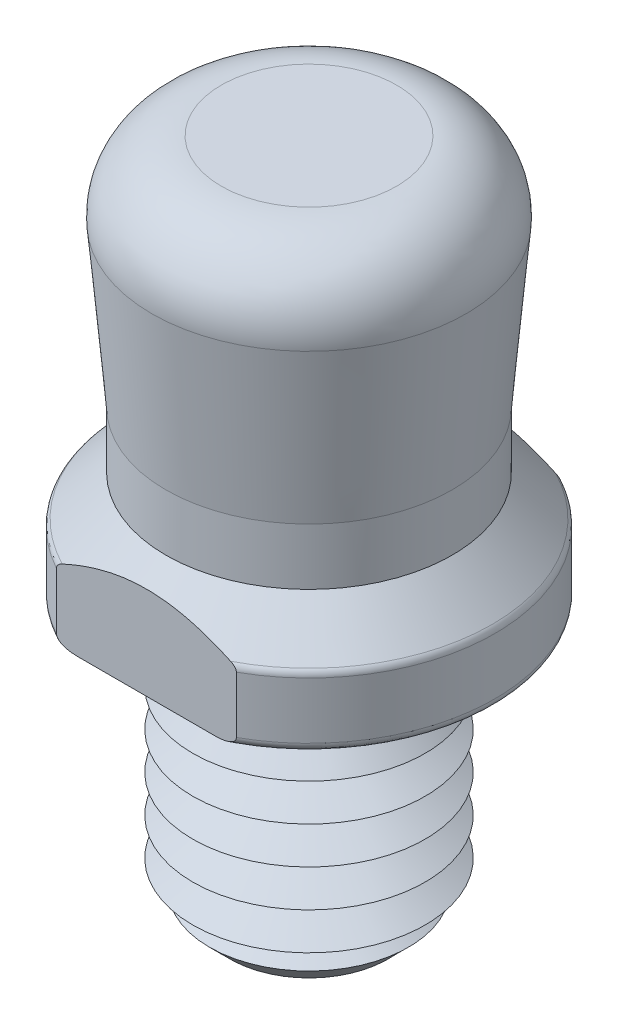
ISO-10303-21;
HEADER;
FILE_DESCRIPTION(('STEP AP214'),'2;1');
FILE_NAME('part.step','',(''),(''),'','','');
FILE_SCHEMA(('AUTOMOTIVE_DESIGN { 1 0 10303 214 1 1 1 1 }'));
ENDSEC;
DATA;
#1=APPLICATION_CONTEXT('core data for automotive mechanical design processes');
#2=APPLICATION_PROTOCOL_DEFINITION('international standard','automotive_design',2000,#1);
#3=PRODUCT_CONTEXT('',#1,'mechanical');
#4=PRODUCT('Part','Part','',(#3));
#5=PRODUCT_RELATED_PRODUCT_CATEGORY('part','',(#4));
#6=PRODUCT_DEFINITION_FORMATION('','',#4);
#7=PRODUCT_DEFINITION_CONTEXT('part definition',#1,'design');
#8=PRODUCT_DEFINITION('design','',#6,#7);
#9=PRODUCT_DEFINITION_SHAPE('','',#8);
#10=(LENGTH_UNIT() NAMED_UNIT(*) SI_UNIT(.MILLI.,.METRE.));
#11=(NAMED_UNIT(*) PLANE_ANGLE_UNIT() SI_UNIT($,.RADIAN.));
#12=(NAMED_UNIT(*) SI_UNIT($,.STERADIAN.) SOLID_ANGLE_UNIT());
#13=UNCERTAINTY_MEASURE_WITH_UNIT(LENGTH_MEASURE(1.E-05),#10,'distance_accuracy_value','');
#14=(GEOMETRIC_REPRESENTATION_CONTEXT(3) GLOBAL_UNCERTAINTY_ASSIGNED_CONTEXT((#13)) GLOBAL_UNIT_ASSIGNED_CONTEXT((#10,
#11,#12)) REPRESENTATION_CONTEXT('',''));
#15=CARTESIAN_POINT('',(0.,0.,0.));
#16=DIRECTION('',(0.,0.,1.));
#17=DIRECTION('',(1.,0.,0.));
#18=AXIS2_PLACEMENT_3D('',#15,#16,#17);
#19=CARTESIAN_POINT('',(0.,0.,0.));
#20=DIRECTION('',(0.,-1.,0.));
#21=DIRECTION('',(0.,0.,-1.));
#22=AXIS2_PLACEMENT_3D('',#19,#20,#21);
#23=PLANE('',#22);
#24=CARTESIAN_POINT('',(0.,0.,0.));
#25=DIRECTION('',(0.,-1.,0.));
#26=DIRECTION('',(0.,0.,-1.));
#27=AXIS2_PLACEMENT_3D('',#24,#25,#26);
#28=CIRCLE('',#27,1.93431457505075);
#29=CARTESIAN_POINT('',(0.,0.,-1.93431457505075));
#30=VERTEX_POINT('',#29);
#31=EDGE_CURVE('E49',#30,#30,#28,.T.);
#32=ORIENTED_EDGE('',*,*,#31,.F.);
#33=EDGE_LOOP('',(#32));
#34=FACE_BOUND('',#33,.T.);
#35=CARTESIAN_POINT('',(0.,0.,0.));
#36=DIRECTION('',(0.,1.,0.));
#37=DIRECTION('',(0.,0.,1.));
#38=AXIS2_PLACEMENT_3D('',#35,#36,#37);
#39=CIRCLE('',#38,3.8);
#40=CARTESIAN_POINT('',(1.47986485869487,0.,3.5));
#41=VERTEX_POINT('',#40);
#42=CARTESIAN_POINT('',(1.47986485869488,0.,-3.5));
#43=VERTEX_POINT('',#42);
#44=EDGE_CURVE('E131',#41,#43,#39,.T.);
#45=ORIENTED_EDGE('',*,*,#44,.F.);
#46=DIRECTION('',(-1.,0.,0.));
#47=VECTOR('',#46,1.);
#48=CARTESIAN_POINT('',(-2.04814984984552,0.,3.5));
#49=LINE('',#48,#47);
#50=CARTESIAN_POINT('',(-1.47986485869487,0.,3.5));
#51=VERTEX_POINT('',#50);
#52=EDGE_CURVE('E116',#41,#51,#49,.T.);
#53=ORIENTED_EDGE('',*,*,#52,.T.);
#54=CARTESIAN_POINT('',(-1.47986485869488,0.,-3.5));
#55=VERTEX_POINT('',#54);
#56=EDGE_CURVE('E124',#55,#51,#39,.T.);
#57=ORIENTED_EDGE('',*,*,#56,.F.);
#58=DIRECTION('',(1.,0.,0.));
#59=VECTOR('',#58,1.);
#60=CARTESIAN_POINT('',(2.04814984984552,0.,-3.5));
#61=LINE('',#60,#59);
#62=EDGE_CURVE('E104',#55,#43,#61,.T.);
#63=ORIENTED_EDGE('',*,*,#62,.T.);
#64=EDGE_LOOP('',(#45,#53,#57,#63));
#65=FACE_BOUND('',#64,.T.);
#66=ADVANCED_FACE('F39',(#34,#65),#23,.T.);
#67=CARTESIAN_POINT('',(0.,0.2,0.));
#68=DIRECTION('',(0.,1.,0.));
#69=DIRECTION('',(0.,0.,1.));
#70=AXIS2_PLACEMENT_3D('',#67,#68,#69);
#71=TOROIDAL_SURFACE('',#70,3.8,0.2);
#72=ORIENTED_EDGE('',*,*,#56,.T.);
#73=CARTESIAN_POINT('',(-1.91579488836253,0.137614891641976,3.5));
#74=CARTESIAN_POINT('',(-1.91926323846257,0.1426873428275,3.5));
#75=CARTESIAN_POINT('',(-1.92240896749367,0.147983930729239,3.5));
#76=CARTESIAN_POINT('',(-1.92787150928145,0.158995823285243,3.5));
#77=CARTESIAN_POINT('',(-1.93018839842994,0.164711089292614,3.5));
#78=CARTESIAN_POINT('',(-1.93381928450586,0.176515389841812,3.5));
#79=CARTESIAN_POINT('',(-1.93512413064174,0.182607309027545,3.5));
#80=CARTESIAN_POINT('',(-1.9365548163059,0.19492653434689,3.5));
#81=CARTESIAN_POINT('',(-1.93668175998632,0.201153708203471,3.5));
#82=CARTESIAN_POINT('',(-1.93579188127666,0.21290639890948,3.5));
#83=CARTESIAN_POINT('',(-1.93488610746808,0.218440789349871,3.5));
#84=CARTESIAN_POINT('',(-1.93219060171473,0.229288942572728,3.5));
#85=CARTESIAN_POINT('',(-1.93040027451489,0.234602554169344,3.5));
#86=CARTESIAN_POINT('',(-1.92533593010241,0.246650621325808,3.5));
#87=CARTESIAN_POINT('',(-1.92176512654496,0.253259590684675,3.5));
#88=CARTESIAN_POINT('',(-1.91361567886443,0.265821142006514,3.5));
#89=CARTESIAN_POINT('',(-1.90903488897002,0.271772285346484,3.5));
#90=CARTESIAN_POINT('',(-1.89625909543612,0.286321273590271,3.5));
#91=CARTESIAN_POINT('',(-1.88751618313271,0.294433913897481,3.5));
#92=CARTESIAN_POINT('',(-1.86893832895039,0.309278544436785,3.5));
#93=CARTESIAN_POINT('',(-1.85910061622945,0.316006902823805,3.5));
#94=CARTESIAN_POINT('',(-1.82954550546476,0.33391015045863,3.5));
#95=CARTESIAN_POINT('',(-1.8089396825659,0.343602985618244,3.5));
#96=CARTESIAN_POINT('',(-1.76663268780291,0.360091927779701,3.5));
#97=CARTESIAN_POINT('',(-1.7449289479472,0.366880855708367,3.5));
#98=CARTESIAN_POINT('',(-1.69941549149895,0.37865591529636,3.5));
#99=CARTESIAN_POINT('',(-1.67556497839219,0.383481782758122,3.5));
#100=CARTESIAN_POINT('',(-1.62753933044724,0.391148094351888,3.5));
#101=CARTESIAN_POINT('',(-1.60336386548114,0.393986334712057,3.5));
#102=CARTESIAN_POINT('',(-1.53050194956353,0.400073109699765,3.5));
#103=CARTESIAN_POINT('',(-1.48160524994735,0.400866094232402,3.5));
#104=CARTESIAN_POINT('',(-1.39924039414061,0.398022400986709,3.5));
#105=CARTESIAN_POINT('',(-1.36570437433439,0.395686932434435,3.5));
#106=CARTESIAN_POINT('',(-1.29884801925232,0.388885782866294,3.5));
#107=CARTESIAN_POINT('',(-1.26552764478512,0.384420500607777,3.5));
#108=CARTESIAN_POINT('',(-1.1993610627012,0.373442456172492,3.5));
#109=CARTESIAN_POINT('',(-1.16651353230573,0.366937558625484,3.5));
#110=CARTESIAN_POINT('',(-1.10135108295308,0.351709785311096,3.5));
#111=CARTESIAN_POINT('',(-1.06903564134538,0.342989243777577,3.5));
#112=CARTESIAN_POINT('',(-1.02136269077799,0.327724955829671,3.5));
#113=CARTESIAN_POINT('',(-1.00564857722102,0.322291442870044,3.5));
#114=CARTESIAN_POINT('',(-0.974536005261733,0.310461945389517,3.5));
#115=CARTESIAN_POINT('',(-0.959138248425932,0.304064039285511,3.5));
#116=CARTESIAN_POINT('',(-0.9315798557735,0.291116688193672,3.5));
#117=CARTESIAN_POINT('',(-0.919317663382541,0.284782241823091,3.5));
#118=CARTESIAN_POINT('',(-0.895599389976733,0.270696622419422,3.5));
#119=CARTESIAN_POINT('',(-0.88414072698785,0.262950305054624,3.5));
#120=CARTESIAN_POINT('',(-0.869555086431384,0.250319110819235,3.5));
#121=CARTESIAN_POINT('',(-0.865536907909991,0.24648543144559,3.5));
#122=CARTESIAN_POINT('',(-0.858094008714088,0.238280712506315,3.5));
#123=CARTESIAN_POINT('',(-0.854666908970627,0.233911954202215,3.5));
#124=CARTESIAN_POINT('',(-0.850114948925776,0.226622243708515,3.5));
#125=CARTESIAN_POINT('',(-0.848643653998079,0.22392021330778,3.5));
#126=CARTESIAN_POINT('',(-0.846118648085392,0.218325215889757,3.5));
#127=CARTESIAN_POINT('',(-0.845064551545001,0.21543242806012,3.5));
#128=CARTESIAN_POINT('',(-0.8434764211,0.209466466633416,3.5));
#129=CARTESIAN_POINT('',(-0.842948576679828,0.206391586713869,3.5));
#130=CARTESIAN_POINT('',(-0.842513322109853,0.200198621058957,3.5));
#131=CARTESIAN_POINT('',(-0.842605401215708,0.197080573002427,3.5));
#132=CARTESIAN_POINT('',(-0.84334104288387,0.191330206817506,3.5));
#133=CARTESIAN_POINT('',(-0.843910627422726,0.188687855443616,3.5));
#134=CARTESIAN_POINT('',(-0.845444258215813,0.183521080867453,3.5));
#135=CARTESIAN_POINT('',(-0.846408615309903,0.180996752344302,3.5));
#136=CARTESIAN_POINT('',(-0.849312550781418,0.174660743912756,3.5));
#137=CARTESIAN_POINT('',(-0.85149256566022,0.170960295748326,3.5));
#138=CARTESIAN_POINT('',(-0.856385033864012,0.163930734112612,3.5));
#139=CARTESIAN_POINT('',(-0.859099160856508,0.160602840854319,3.5));
#140=CARTESIAN_POINT('',(-0.869011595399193,0.149705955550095,3.5));
#141=CARTESIAN_POINT('',(-0.877048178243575,0.142915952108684,3.5));
#142=CARTESIAN_POINT('',(-0.893966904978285,0.130491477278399,3.5));
#143=CARTESIAN_POINT('',(-0.902854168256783,0.124864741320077,3.5));
#144=CARTESIAN_POINT('',(-0.927449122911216,0.11072330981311,3.5));
#145=CARTESIAN_POINT('',(-0.943577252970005,0.102943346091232,3.5));
#146=CARTESIAN_POINT('',(-0.976421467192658,0.0887187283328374,3.5));
#147=CARTESIAN_POINT('',(-0.993138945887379,0.0822775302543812,3.5));
#148=CARTESIAN_POINT('',(-1.02696484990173,0.0703575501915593,3.5));
#149=CARTESIAN_POINT('',(-1.04407421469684,0.0648814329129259,3.5));
#150=CARTESIAN_POINT('',(-1.07850036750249,0.0547208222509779,3.5));
#151=CARTESIAN_POINT('',(-1.09581689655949,0.0500354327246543,3.5));
#152=CARTESIAN_POINT('',(-1.14790460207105,0.0370137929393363,3.5));
#153=CARTESIAN_POINT('',(-1.18292751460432,0.0296741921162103,3.5));
#154=CARTESIAN_POINT('',(-1.25341265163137,0.0173307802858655,3.5));
#155=CARTESIAN_POINT('',(-1.28887530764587,0.0123294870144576,3.5));
#156=CARTESIAN_POINT('',(-1.35989336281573,0.00474427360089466,3.5));
#157=CARTESIAN_POINT('',(-1.39544754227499,0.0021490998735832,3.5));
#158=CARTESIAN_POINT('',(-1.4666276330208,-0.000387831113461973,3.5));
#159=CARTESIAN_POINT('',(-1.50225343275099,-0.00033231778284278,3.5));
#160=CARTESIAN_POINT('',(-1.56438649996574,0.0025546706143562,3.5));
#161=CARTESIAN_POINT('',(-1.59092565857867,0.00468193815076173,3.5));
#162=CARTESIAN_POINT('',(-1.64381527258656,0.0111033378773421,3.5));
#163=CARTESIAN_POINT('',(-1.67016522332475,0.0154019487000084,3.5));
#164=CARTESIAN_POINT('',(-1.72252370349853,0.0268039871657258,3.5));
#165=CARTESIAN_POINT('',(-1.74852661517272,0.0339336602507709,3.5));
#166=CARTESIAN_POINT('',(-1.79923871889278,0.0520010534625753,3.5));
#167=CARTESIAN_POINT('',(-1.82395181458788,0.0629264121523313,3.5));
#168=CARTESIAN_POINT('',(-1.85734181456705,0.0828410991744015,3.5));
#169=CARTESIAN_POINT('',(-1.86734699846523,0.0895759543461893,3.5));
#170=CARTESIAN_POINT('',(-1.88623265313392,0.104432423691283,3.5));
#171=CARTESIAN_POINT('',(-1.89511906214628,0.112546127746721,3.5));
#172=CARTESIAN_POINT('',(-1.90766172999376,0.126584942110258,3.5));
#173=CARTESIAN_POINT('',(-1.91192874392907,0.131960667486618,3.5));
#174=CARTESIAN_POINT('',(-1.91579488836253,0.137614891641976,3.5));
#175=B_SPLINE_CURVE_WITH_KNOTS('',3,(#73,#74,#75,#76,#77,#78,#79,#80,#81,#82,#83,#84,#85,#86,
#87,#88,#89,#90,#91,#92,#93,#94,#95,#96,#97,#98,#99,#100,#101,#102,#103,#104,#105,#106,#107,
#108,#109,#110,#111,#112,#113,#114,#115,#116,#117,#118,#119,#120,#121,#122,#123,#124,#125,#126,
#127,#128,#129,#130,#131,#132,#133,#134,#135,#136,#137,#138,#139,#140,#141,#142,#143,#144,#145,
#146,#147,#148,#149,#150,#151,#152,#153,#154,#155,#156,#157,#158,#159,#160,#161,#162,#163,#164,
#165,#166,#167,#168,#169,#170,#171,#172,#173,#174),.UNSPECIFIED.,.T.,.F.,(4,2,2,2,2,2,2,2,2,2,2,
2,2,2,2,2,2,2,2,2,2,2,2,2,2,2,2,2,2,2,2,2,2,2,2,2,2,2,2,2,2,2,2,2,2,2,2,2,2,2,4),(0.,
0.0184217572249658,0.0368418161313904,0.0554265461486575,0.0739938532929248,0.090738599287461,
0.107494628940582,0.129904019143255,0.152361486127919,0.187940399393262,0.223611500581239,
0.291544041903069,0.359643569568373,0.432529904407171,0.505496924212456,0.651812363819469,
0.752613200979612,0.853395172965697,0.953793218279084,1.05408592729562,1.10394986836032,
1.15391451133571,1.19529249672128,1.23653077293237,1.2531587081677,1.26971807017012,
1.27892161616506,1.28811663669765,1.29741857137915,1.30671284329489,1.31478708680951,
1.32286770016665,1.335677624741,1.34852834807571,1.37984906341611,1.41137179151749,
1.46495539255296,1.51867564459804,1.57254197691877,1.62634684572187,1.73359831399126,
1.84096499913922,1.94782695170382,2.05457887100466,2.13438591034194,2.21435823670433,
2.29508993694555,2.37556114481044,2.41165867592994,2.44755571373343,2.46809031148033),.UNSPECIFIED.);
#176=CARTESIAN_POINT('',(-1.93649167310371,0.200000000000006,3.5));
#177=VERTEX_POINT('',#176);
#178=EDGE_CURVE('E216',#51,#177,#175,.T.);
#179=ORIENTED_EDGE('',*,*,#178,.T.);
#180=CARTESIAN_POINT('',(0.,0.200000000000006,0.));
#181=DIRECTION('',(0.,1.,0.));
#182=DIRECTION('',(0.,0.,1.));
#183=AXIS2_PLACEMENT_3D('',#180,#181,#182);
#184=CIRCLE('',#183,4.);
#185=CARTESIAN_POINT('',(-1.93649167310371,0.200000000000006,-3.5));
#186=VERTEX_POINT('',#185);
#187=EDGE_CURVE('E126',#186,#177,#184,.T.);
#188=ORIENTED_EDGE('',*,*,#187,.F.);
#189=CARTESIAN_POINT('',(-1.91579488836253,0.137614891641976,-3.5));
#190=CARTESIAN_POINT('',(-1.90876025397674,0.127326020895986,-3.5));
#191=CARTESIAN_POINT('',(-1.90038733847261,0.117936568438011,-3.5));
#192=CARTESIAN_POINT('',(-1.88206919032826,0.100792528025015,-3.5));
#193=CARTESIAN_POINT('',(-1.87211067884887,0.0930531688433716,-3.5));
#194=CARTESIAN_POINT('',(-1.84485203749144,0.0745965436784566,-3.5));
#195=CARTESIAN_POINT('',(-1.82681184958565,0.0649863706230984,-3.5));
#196=CARTESIAN_POINT('',(-1.78965731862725,0.0483925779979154,-3.5));
#197=CARTESIAN_POINT('',(-1.77054367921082,0.0414072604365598,-3.5));
#198=CARTESIAN_POINT('',(-1.73070092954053,0.0291014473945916,-3.5));
#199=CARTESIAN_POINT('',(-1.70993959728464,0.0238870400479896,-3.5));
#200=CARTESIAN_POINT('',(-1.66804940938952,0.015190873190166,-3.5));
#201=CARTESIAN_POINT('',(-1.64692017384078,0.0117110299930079,-3.5));
#202=CARTESIAN_POINT('',(-1.5830420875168,0.00337368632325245,-3.5));
#203=CARTESIAN_POINT('',(-1.54001111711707,0.000674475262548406,-3.5));
#204=CARTESIAN_POINT('',(-1.45444135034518,-0.000443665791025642,-3.5));
#205=CARTESIAN_POINT('',(-1.41190253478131,0.00108896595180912,-3.5));
#206=CARTESIAN_POINT('',(-1.32709909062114,0.00766165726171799,-3.5));
#207=CARTESIAN_POINT('',(-1.28483449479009,0.0127021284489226,-3.5));
#208=CARTESIAN_POINT('',(-1.2010756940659,0.0260201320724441,-3.5));
#209=CARTESIAN_POINT('',(-1.15957834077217,0.0342774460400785,-3.5));
#210=CARTESIAN_POINT('',(-1.09805574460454,0.049402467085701,-3.5));
#211=CARTESIAN_POINT('',(-1.07768811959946,0.0548940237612,-3.5));
#212=CARTESIAN_POINT('',(-1.03727992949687,0.0669678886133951,-3.5));
#213=CARTESIAN_POINT('',(-1.01723920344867,0.0735496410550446,-3.5));
#214=CARTESIAN_POINT('',(-0.985599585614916,0.0852449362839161,-3.5));
#215=CARTESIAN_POINT('',(-0.973828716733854,0.0898935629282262,-3.5));
#216=CARTESIAN_POINT('',(-0.950522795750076,0.0998910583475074,-3.5));
#217=CARTESIAN_POINT('',(-0.938988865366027,0.105242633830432,-3.5));
#218=CARTESIAN_POINT('',(-0.916290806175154,0.11695582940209,-3.5));
#219=CARTESIAN_POINT('',(-0.905132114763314,0.123327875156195,-3.5));
#220=CARTESIAN_POINT('',(-0.883787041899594,0.137551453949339,-3.5));
#221=CARTESIAN_POINT('',(-0.873594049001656,0.145391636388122,-3.5));
#222=CARTESIAN_POINT('',(-0.861767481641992,0.15756716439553,-3.5));
#223=CARTESIAN_POINT('',(-0.858967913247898,0.160740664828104,-3.5));
#224=CARTESIAN_POINT('',(-0.853822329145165,0.167438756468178,-3.5));
#225=CARTESIAN_POINT('',(-0.851475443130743,0.170962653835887,-3.5));
#226=CARTESIAN_POINT('',(-0.848032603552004,0.177325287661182,-3.5));
#227=CARTESIAN_POINT('',(-0.8467707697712,0.180072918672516,-3.5));
#228=CARTESIAN_POINT('',(-0.844703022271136,0.185735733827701,-3.5));
#229=CARTESIAN_POINT('',(-0.84389649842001,0.188650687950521,-3.5));
#230=CARTESIAN_POINT('',(-0.842829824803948,0.19461053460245,-3.5));
#231=CARTESIAN_POINT('',(-0.842574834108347,0.1976563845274,-3.5));
#232=CARTESIAN_POINT('',(-0.842665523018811,0.203739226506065,-3.5));
#233=CARTESIAN_POINT('',(-0.843011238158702,0.206776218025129,-3.5));
#234=CARTESIAN_POINT('',(-0.844175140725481,0.212366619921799,-3.5));
#235=CARTESIAN_POINT('',(-0.844930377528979,0.214933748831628,-3.5));
#236=CARTESIAN_POINT('',(-0.846793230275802,0.219934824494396,-3.5));
#237=CARTESIAN_POINT('',(-0.847900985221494,0.222368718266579,-3.5));
#238=CARTESIAN_POINT('',(-0.8513548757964,0.228906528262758,-3.5));
#239=CARTESIAN_POINT('',(-0.853997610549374,0.232852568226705,-3.5));
#240=CARTESIAN_POINT('',(-0.85983555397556,0.24031345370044,-3.5));
#241=CARTESIAN_POINT('',(-0.863032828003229,0.243826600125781,-3.5));
#242=CARTESIAN_POINT('',(-0.875294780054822,0.255989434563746,-3.5));
#243=CARTESIAN_POINT('',(-0.885369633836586,0.263596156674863,-3.5));
#244=CARTESIAN_POINT('',(-0.906420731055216,0.277427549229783,-3.5));
#245=CARTESIAN_POINT('',(-0.917402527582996,0.283642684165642,-3.5));
#246=CARTESIAN_POINT('',(-0.9484858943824,0.299610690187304,-3.5));
#247=CARTESIAN_POINT('',(-0.9690860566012,0.308392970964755,-3.5));
#248=CARTESIAN_POINT('',(-1.01092914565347,0.32429593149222,-3.5));
#249=CARTESIAN_POINT('',(-1.03217357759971,0.331412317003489,-3.5));
#250=CARTESIAN_POINT('',(-1.07508244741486,0.34440568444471,-3.5));
#251=CARTESIAN_POINT('',(-1.0967475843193,0.350280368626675,-3.5));
#252=CARTESIAN_POINT('',(-1.14030387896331,0.360979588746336,-3.5));
#253=CARTESIAN_POINT('',(-1.16219475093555,0.365805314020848,-3.5));
#254=CARTESIAN_POINT('',(-1.21850045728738,0.37695388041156,-3.5));
#255=CARTESIAN_POINT('',(-1.25305162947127,0.382597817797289,-3.5));
#256=CARTESIAN_POINT('',(-1.32247707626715,0.391642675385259,-3.5));
#257=CARTESIAN_POINT('',(-1.357351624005,0.395041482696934,-3.5));
#258=CARTESIAN_POINT('',(-1.42716713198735,0.399391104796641,-3.5));
#259=CARTESIAN_POINT('',(-1.46210765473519,0.40034854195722,-3.5));
#260=CARTESIAN_POINT('',(-1.53191750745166,0.399426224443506,-3.5));
#261=CARTESIAN_POINT('',(-1.5667868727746,0.39754981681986,-3.5));
#262=CARTESIAN_POINT('',(-1.6362484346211,0.390255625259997,-3.5));
#263=CARTESIAN_POINT('',(-1.67084028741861,0.384833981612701,-3.5));
#264=CARTESIAN_POINT('',(-1.72190026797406,0.373057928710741,-3.5));
#265=CARTESIAN_POINT('',(-1.73878685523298,0.368523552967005,-3.5));
#266=CARTESIAN_POINT('',(-1.77207852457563,0.357959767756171,-3.5));
#267=CARTESIAN_POINT('',(-1.78848419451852,0.351932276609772,-3.5));
#268=CARTESIAN_POINT('',(-1.82061821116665,0.337939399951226,-3.5));
#269=CARTESIAN_POINT('',(-1.83634003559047,0.329958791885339,-3.5));
#270=CARTESIAN_POINT('',(-1.86621428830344,0.311506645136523,-3.5));
#271=CARTESIAN_POINT('',(-1.88037772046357,0.301054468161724,-3.5));
#272=CARTESIAN_POINT('',(-1.89800038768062,0.284166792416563,-3.5));
#273=CARTESIAN_POINT('',(-1.90276856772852,0.279103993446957,-3.5));
#274=CARTESIAN_POINT('',(-1.91163788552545,0.26840883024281,-3.5));
#275=CARTESIAN_POINT('',(-1.91573860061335,0.262776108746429,-3.5));
#276=CARTESIAN_POINT('',(-1.92307770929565,0.250873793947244,-3.5));
#277=CARTESIAN_POINT('',(-1.92630577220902,0.244597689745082,-3.5));
#278=CARTESIAN_POINT('',(-1.93154286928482,0.231555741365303,-3.5));
#279=CARTESIAN_POINT('',(-1.93355432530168,0.224790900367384,-3.5));
#280=CARTESIAN_POINT('',(-1.9360180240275,0.211516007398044,-3.5));
#281=CARTESIAN_POINT('',(-1.93657830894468,0.205026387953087,-3.5));
#282=CARTESIAN_POINT('',(-1.93638320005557,0.192065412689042,-3.5));
#283=CARTESIAN_POINT('',(-1.93562770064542,0.185594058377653,-3.5));
#284=CARTESIAN_POINT('',(-1.93310411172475,0.173877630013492,-3.5));
#285=CARTESIAN_POINT('',(-1.93150521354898,0.168594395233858,-3.5));
#286=CARTESIAN_POINT('',(-1.92755174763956,0.15832411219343,-3.5));
#287=CARTESIAN_POINT('',(-1.92519759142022,0.153336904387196,-3.5));
#288=CARTESIAN_POINT('',(-1.92150050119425,0.146653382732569,-3.5));
#289=CARTESIAN_POINT('',(-1.92041803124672,0.144807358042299,-3.5));
#290=CARTESIAN_POINT('',(-1.91816839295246,0.141170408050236,-3.5));
#291=CARTESIAN_POINT('',(-1.91700132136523,0.139379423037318,-3.5));
#292=CARTESIAN_POINT('',(-1.91579488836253,0.137614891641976,-3.5));
#293=B_SPLINE_CURVE_WITH_KNOTS('',3,(#189,#190,#191,#192,#193,#194,#195,#196,#197,#198,#199,
#200,#201,#202,#203,#204,#205,#206,#207,#208,#209,#210,#211,#212,#213,#214,#215,#216,#217,#218,
#219,#220,#221,#222,#223,#224,#225,#226,#227,#228,#229,#230,#231,#232,#233,#234,#235,#236,#237,
#238,#239,#240,#241,#242,#243,#244,#245,#246,#247,#248,#249,#250,#251,#252,#253,#254,#255,#256,
#257,#258,#259,#260,#261,#262,#263,#264,#265,#266,#267,#268,#269,#270,#271,#272,#273,#274,#275,
#276,#277,#278,#279,#280,#281,#282,#283,#284,#285,#286,#287,#288,#289,#290,#291,#292),
.UNSPECIFIED.,.T.,.F.,(4,2,2,2,2,2,2,2,2,2,2,2,2,2,2,2,2,2,2,2,2,2,2,2,2,2,2,2,2,2,2,2,2,2,2,2,
2,2,2,2,2,2,2,2,2,2,2,2,2,2,2,4),(0.,0.0373829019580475,0.0750971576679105,0.136070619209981,
0.197004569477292,0.261123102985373,0.325312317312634,0.454331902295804,0.581880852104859,
0.709444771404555,0.836219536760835,0.899484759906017,0.962717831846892,1.00067234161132,
1.03877753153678,1.07730028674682,1.11553666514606,1.12820593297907,1.14085059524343,
1.14989011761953,1.15891749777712,1.16802896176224,1.17714096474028,1.18513863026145,
1.19313945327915,1.20730374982,1.22152198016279,1.25909797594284,1.29692406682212,
1.36393691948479,1.43112065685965,1.49842764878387,1.5656579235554,1.67060487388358,
1.77565044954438,1.88041077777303,1.9850474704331,2.08979827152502,2.14220269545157,
2.19454013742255,2.24729926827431,2.29965804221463,2.32047955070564,2.34131419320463,
2.3623856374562,2.38341499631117,2.4028266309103,2.42223982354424,2.43873627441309,
2.45522375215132,2.46164211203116,2.46805324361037),.UNSPECIFIED.);
#294=EDGE_CURVE('E107',#186,#55,#293,.T.);
#295=ORIENTED_EDGE('',*,*,#294,.T.);
#296=EDGE_LOOP('',(#72,#179,#188,#295));
#297=FACE_BOUND('',#296,.T.);
#298=ADVANCED_FACE('F122',(#297),#71,.T.);
#299=CARTESIAN_POINT('',(1.93649167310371,0.200000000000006,3.5));
#300=VERTEX_POINT('',#299);
#301=CARTESIAN_POINT('',(1.93649167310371,0.200000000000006,-3.5));
#302=VERTEX_POINT('',#301);
#303=EDGE_CURVE('E132',#300,#302,#184,.T.);
#304=ORIENTED_EDGE('',*,*,#303,.F.);
#305=CARTESIAN_POINT('',(0.843669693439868,0.190062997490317,3.5));
#306=CARTESIAN_POINT('',(0.843069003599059,0.192894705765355,3.5));
#307=CARTESIAN_POINT('',(0.842715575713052,0.195781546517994,3.5));
#308=CARTESIAN_POINT('',(0.842551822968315,0.201570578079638,3.5));
#309=CARTESIAN_POINT('',(0.842741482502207,0.204472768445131,3.5));
#310=CARTESIAN_POINT('',(0.843635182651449,0.210180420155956,3.5));
#311=CARTESIAN_POINT('',(0.844336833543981,0.212986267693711,3.5));
#312=CARTESIAN_POINT('',(0.846171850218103,0.218451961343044,3.5));
#313=CARTESIAN_POINT('',(0.847305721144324,0.221111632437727,3.5));
#314=CARTESIAN_POINT('',(0.850668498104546,0.227757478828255,3.5));
#315=CARTESIAN_POINT('',(0.853150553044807,0.231614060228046,3.5));
#316=CARTESIAN_POINT('',(0.858657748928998,0.238916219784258,3.5));
#317=CARTESIAN_POINT('',(0.861684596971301,0.242360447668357,3.5));
#318=CARTESIAN_POINT('',(0.87311779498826,0.254082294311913,3.5));
#319=CARTESIAN_POINT('',(0.88247558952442,0.261410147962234,3.5));
#320=CARTESIAN_POINT('',(0.902073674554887,0.274761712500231,3.5));
#321=CARTESIAN_POINT('',(0.912319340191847,0.280776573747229,3.5));
#322=CARTESIAN_POINT('',(0.941125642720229,0.296131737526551,3.5));
#323=CARTESIAN_POINT('',(0.9601594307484,0.304582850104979,3.5));
#324=CARTESIAN_POINT('',(0.998851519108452,0.319938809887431,3.5));
#325=CARTESIAN_POINT('',(1.01851129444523,0.326839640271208,3.5));
#326=CARTESIAN_POINT('',(1.05826427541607,0.339510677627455,3.5));
#327=CARTESIAN_POINT('',(1.07835869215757,0.345277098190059,3.5));
#328=CARTESIAN_POINT('',(1.11876628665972,0.355854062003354,3.5));
#329=CARTESIAN_POINT('',(1.13907917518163,0.360665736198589,3.5));
#330=CARTESIAN_POINT('',(1.20041461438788,0.373870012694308,3.5));
#331=CARTESIAN_POINT('',(1.24171491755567,0.380995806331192,3.5));
#332=CARTESIAN_POINT('',(1.32480829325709,0.392058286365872,3.5));
#333=CARTESIAN_POINT('',(1.36660208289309,0.395989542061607,3.5));
#334=CARTESIAN_POINT('',(1.45018964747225,0.400277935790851,3.5));
#335=CARTESIAN_POINT('',(1.49198253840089,0.400651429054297,3.5));
#336=CARTESIAN_POINT('',(1.57534167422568,0.397079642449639,3.5));
#337=CARTESIAN_POINT('',(1.61690822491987,0.393145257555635,3.5));
#338=CARTESIAN_POINT('',(1.68532271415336,0.381682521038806,3.5));
#339=CARTESIAN_POINT('',(1.71244282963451,0.375796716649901,3.5));
#340=CARTESIAN_POINT('',(1.76564870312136,0.360570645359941,3.5));
#341=CARTESIAN_POINT('',(1.79173914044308,0.351248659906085,3.5));
#342=CARTESIAN_POINT('',(1.82616352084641,0.334928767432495,3.5));
#343=CARTESIAN_POINT('',(1.8355023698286,0.330057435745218,3.5));
#344=CARTESIAN_POINT('',(1.85369497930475,0.319430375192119,3.5));
#345=CARTESIAN_POINT('',(1.86254786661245,0.313673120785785,3.5));
#346=CARTESIAN_POINT('',(1.87958725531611,0.301054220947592,3.5));
#347=CARTESIAN_POINT('',(1.88776574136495,0.294181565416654,3.5));
#348=CARTESIAN_POINT('',(1.90289732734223,0.279194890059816,3.5));
#349=CARTESIAN_POINT('',(1.90985461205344,0.271085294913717,3.5));
#350=CARTESIAN_POINT('',(1.91937569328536,0.257140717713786,3.5));
#351=CARTESIAN_POINT('',(1.92257054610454,0.251738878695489,3.5));
#352=CARTESIAN_POINT('',(1.92809340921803,0.240504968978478,3.5));
#353=CARTESIAN_POINT('',(1.93042216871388,0.234673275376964,3.5));
#354=CARTESIAN_POINT('',(1.93403303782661,0.222625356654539,3.5));
#355=CARTESIAN_POINT('',(1.93530485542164,0.216405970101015,3.5));
#356=CARTESIAN_POINT('',(1.93661947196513,0.203838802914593,3.5));
#357=CARTESIAN_POINT('',(1.93666316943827,0.197491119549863,3.5));
#358=CARTESIAN_POINT('',(1.93558721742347,0.185649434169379,3.5));
#359=CARTESIAN_POINT('',(1.93460304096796,0.180142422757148,3.5));
#360=CARTESIAN_POINT('',(1.93176512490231,0.169358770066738,3.5));
#361=CARTESIAN_POINT('',(1.92991088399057,0.164082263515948,3.5));
#362=CARTESIAN_POINT('',(1.92466828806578,0.152016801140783,3.5));
#363=CARTESIAN_POINT('',(1.92096824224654,0.145364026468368,3.5));
#364=CARTESIAN_POINT('',(1.91255735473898,0.132733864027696,3.5));
#365=CARTESIAN_POINT('',(1.90784427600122,0.126758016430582,3.5));
#366=CARTESIAN_POINT('',(1.89467122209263,0.11209766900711,3.5));
#367=CARTESIAN_POINT('',(1.88565169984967,0.103920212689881,3.5));
#368=CARTESIAN_POINT('',(1.86651769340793,0.088983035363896,3.5));
#369=CARTESIAN_POINT('',(1.85640043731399,0.0822270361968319,3.5));
#370=CARTESIAN_POINT('',(1.82592101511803,0.0642113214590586,3.5));
#371=CARTESIAN_POINT('',(1.80465880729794,0.0544904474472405,3.5));
#372=CARTESIAN_POINT('',(1.76104395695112,0.0380271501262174,3.5));
#373=CARTESIAN_POINT('',(1.73868872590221,0.0312922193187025,3.5));
#374=CARTESIAN_POINT('',(1.69178737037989,0.0196777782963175,3.5));
#375=CARTESIAN_POINT('',(1.66719987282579,0.014968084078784,3.5));
#376=CARTESIAN_POINT('',(1.61771231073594,0.00759409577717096,3.5));
#377=CARTESIAN_POINT('',(1.5928119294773,0.00493207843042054,3.5));
#378=CARTESIAN_POINT('',(1.5177992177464,-0.000549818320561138,3.5));
#379=CARTESIAN_POINT('',(1.46749578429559,-0.000840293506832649,3.5));
#380=CARTESIAN_POINT('',(1.38502141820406,0.00290015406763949,3.5));
#381=CARTESIAN_POINT('',(1.35275519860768,0.00543305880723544,3.5));
#382=CARTESIAN_POINT('',(1.28843638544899,0.0124595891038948,3.5));
#383=CARTESIAN_POINT('',(1.25638374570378,0.0169527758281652,3.5));
#384=CARTESIAN_POINT('',(1.19272666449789,0.0278417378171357,3.5));
#385=CARTESIAN_POINT('',(1.16112102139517,0.0342305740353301,3.5));
#386=CARTESIAN_POINT('',(1.09841347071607,0.0490833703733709,3.5));
#387=CARTESIAN_POINT('',(1.06731110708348,0.0575453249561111,3.5));
#388=CARTESIAN_POINT('',(1.02325218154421,0.0716778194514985,3.5));
#389=CARTESIAN_POINT('',(1.00993811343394,0.076237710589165,3.5));
#390=CARTESIAN_POINT('',(0.983531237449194,0.0860208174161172,3.5));
#391=CARTESIAN_POINT('',(0.970438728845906,0.091244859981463,3.5));
#392=CARTESIAN_POINT('',(0.945225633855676,0.10230582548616,3.5));
#393=CARTESIAN_POINT('',(0.933087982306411,0.108103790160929,3.5));
#394=CARTESIAN_POINT('',(0.909413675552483,0.120828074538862,3.5));
#395=CARTESIAN_POINT('',(0.897875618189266,0.127751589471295,3.5));
#396=CARTESIAN_POINT('',(0.882518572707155,0.138856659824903,3.5));
#397=CARTESIAN_POINT('',(0.87814447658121,0.142261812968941,3.5));
#398=CARTESIAN_POINT('',(0.869748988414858,0.14949472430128,3.5));
#399=CARTESIAN_POINT('',(0.865727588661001,0.153322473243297,3.5));
#400=CARTESIAN_POINT('',(0.859280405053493,0.160399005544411,3.5));
#401=CARTESIAN_POINT('',(0.856718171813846,0.163521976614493,3.5));
#402=CARTESIAN_POINT('',(0.852055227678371,0.17009448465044,3.5));
#403=CARTESIAN_POINT('',(0.849953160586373,0.1735430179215,3.5));
#404=CARTESIAN_POINT('',(0.84718709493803,0.179210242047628,3.5));
#405=CARTESIAN_POINT('',(0.846294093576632,0.181316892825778,3.5));
#406=CARTESIAN_POINT('',(0.844772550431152,0.185625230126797,3.5));
#407=CARTESIAN_POINT('',(0.844144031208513,0.187826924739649,3.5));
#408=CARTESIAN_POINT('',(0.843669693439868,0.190062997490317,3.5));
#409=B_SPLINE_CURVE_WITH_KNOTS('',3,(#305,#306,#307,#308,#309,#310,#311,#312,#313,#314,#315,
#316,#317,#318,#319,#320,#321,#322,#323,#324,#325,#326,#327,#328,#329,#330,#331,#332,#333,#334,
#335,#336,#337,#338,#339,#340,#341,#342,#343,#344,#345,#346,#347,#348,#349,#350,#351,#352,#353,
#354,#355,#356,#357,#358,#359,#360,#361,#362,#363,#364,#365,#366,#367,#368,#369,#370,#371,#372,
#373,#374,#375,#376,#377,#378,#379,#380,#381,#382,#383,#384,#385,#386,#387,#388,#389,#390,#391,
#392,#393,#394,#395,#396,#397,#398,#399,#400,#401,#402,#403,#404,#405,#406,#407,#408),
.UNSPECIFIED.,.T.,.F.,(4,2,2,2,2,2,2,2,2,2,2,2,2,2,2,2,2,2,2,2,2,2,2,2,2,2,2,2,2,2,2,2,2,2,2,2,
2,2,2,2,2,2,2,2,2,2,2,2,2,2,2,4),(0.,0.0086751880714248,0.0173501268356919,0.0259848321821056,
0.0346296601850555,0.0483093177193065,0.0620326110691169,0.0974122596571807,0.133023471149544,
0.195342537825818,0.257821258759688,0.320505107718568,0.383114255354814,0.508704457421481,
0.634507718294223,0.75973237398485,0.884641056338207,0.967764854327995,1.05045264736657,
1.08201632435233,1.11363497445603,1.14558718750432,1.17742767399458,1.19619530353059,
1.21494666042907,1.23387853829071,1.25279656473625,1.26950184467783,1.2862167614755,
1.3089257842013,1.33168547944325,1.36800316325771,1.40441478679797,1.47415902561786,
1.54407729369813,1.61906210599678,1.69413017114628,1.84463226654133,1.9416867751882,
2.03871956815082,2.13540146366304,2.23199019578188,2.27419892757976,2.31646073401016,
2.35678965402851,2.3970195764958,2.41363226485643,2.43024458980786,2.44233727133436,
2.45439381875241,2.46124364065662,2.4680940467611),.UNSPECIFIED.);
#410=EDGE_CURVE('E210',#300,#41,#409,.T.);
#411=ORIENTED_EDGE('',*,*,#410,.T.);
#412=ORIENTED_EDGE('',*,*,#44,.T.);
#413=CARTESIAN_POINT('',(0.842614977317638,0.2,-3.5));
#414=CARTESIAN_POINT('',(0.842615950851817,0.196646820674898,-3.5));
#415=CARTESIAN_POINT('',(0.842981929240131,0.193289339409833,-3.5));
#416=CARTESIAN_POINT('',(0.844383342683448,0.186715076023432,-3.5));
#417=CARTESIAN_POINT('',(0.845420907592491,0.183498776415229,-3.5));
#418=CARTESIAN_POINT('',(0.848332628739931,0.176546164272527,-3.5));
#419=CARTESIAN_POINT('',(0.850347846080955,0.172870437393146,-3.5));
#420=CARTESIAN_POINT('',(0.85492305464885,0.165880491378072,-3.5));
#421=CARTESIAN_POINT('',(0.857484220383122,0.162567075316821,-3.5));
#422=CARTESIAN_POINT('',(0.865457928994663,0.153378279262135,-3.5));
#423=CARTESIAN_POINT('',(0.871342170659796,0.147919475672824,-3.5));
#424=CARTESIAN_POINT('',(0.883752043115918,0.137801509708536,-3.5));
#425=CARTESIAN_POINT('',(0.890279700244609,0.133145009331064,-3.5));
#426=CARTESIAN_POINT('',(0.908811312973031,0.121066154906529,-3.5));
#427=CARTESIAN_POINT('',(0.921199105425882,0.114238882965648,-3.5));
#428=CARTESIAN_POINT('',(0.946517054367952,0.101659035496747,-3.5));
#429=CARTESIAN_POINT('',(0.95944851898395,0.0959092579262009,-3.5));
#430=CARTESIAN_POINT('',(0.985703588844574,0.0851584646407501,-3.5));
#431=CARTESIAN_POINT('',(0.999029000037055,0.0801618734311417,-3.5));
#432=CARTESIAN_POINT('',(1.02587438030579,0.0707895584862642,-3.5));
#433=CARTESIAN_POINT('',(1.03939409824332,0.0664131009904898,-3.5));
#434=CARTESIAN_POINT('',(1.0928026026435,0.0501942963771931,-3.5));
#435=CARTESIAN_POINT('',(1.13326569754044,0.0402294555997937,-3.5));
#436=CARTESIAN_POINT('',(1.21489971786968,0.0235214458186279,-3.5));
#437=CARTESIAN_POINT('',(1.25607185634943,0.0167845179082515,-3.5));
#438=CARTESIAN_POINT('',(1.33870594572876,0.00652595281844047,-3.5));
#439=CARTESIAN_POINT('',(1.38016671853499,0.00299509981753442,-3.5));
#440=CARTESIAN_POINT('',(1.4631756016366,-0.000504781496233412,-3.5));
#441=CARTESIAN_POINT('',(1.50472344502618,-0.000479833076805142,-3.5));
#442=CARTESIAN_POINT('',(1.58621236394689,0.00388065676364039,-3.5));
#443=CARTESIAN_POINT('',(1.62615920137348,0.0080667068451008,-3.5));
#444=CARTESIAN_POINT('',(1.6853504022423,0.0185434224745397,-3.5));
#445=CARTESIAN_POINT('',(1.70496481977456,0.0227370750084,-3.5));
#446=CARTESIAN_POINT('',(1.74373335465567,0.0328558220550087,-3.5));
#447=CARTESIAN_POINT('',(1.762888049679,0.03877860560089,-3.5));
#448=CARTESIAN_POINT('',(1.80055756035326,0.0528895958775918,-3.5));
#449=CARTESIAN_POINT('',(1.81906487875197,0.0610981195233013,-3.5));
#450=CARTESIAN_POINT('',(1.85439990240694,0.0805035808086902,-3.5));
#451=CARTESIAN_POINT('',(1.87124069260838,0.0916741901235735,-3.5));
#452=CARTESIAN_POINT('',(1.89161005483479,0.109564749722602,-3.5));
#453=CARTESIAN_POINT('',(1.89670460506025,0.114491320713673,-3.5));
#454=CARTESIAN_POINT('',(1.90628444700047,0.124922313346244,-3.5));
#455=CARTESIAN_POINT('',(1.91076922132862,0.130427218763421,-3.5));
#456=CARTESIAN_POINT('',(1.91894719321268,0.142095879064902,-3.5));
#457=CARTESIAN_POINT('',(1.92263141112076,0.148266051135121,-3.5));
#458=CARTESIAN_POINT('',(1.92884706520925,0.161162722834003,-3.5));
#459=CARTESIAN_POINT('',(1.93138107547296,0.167887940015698,-3.5));
#460=CARTESIAN_POINT('',(1.93460741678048,0.180168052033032,-3.5));
#461=CARTESIAN_POINT('',(1.93558507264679,0.185647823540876,-3.5));
#462=CARTESIAN_POINT('',(1.93659269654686,0.196693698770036,-3.5));
#463=CARTESIAN_POINT('',(1.93662316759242,0.202259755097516,-3.5));
#464=CARTESIAN_POINT('',(1.93573411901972,0.213308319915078,-3.5));
#465=CARTESIAN_POINT('',(1.93481551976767,0.218790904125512,-3.5));
#466=CARTESIAN_POINT('',(1.93211154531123,0.229537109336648,-3.5));
#467=CARTESIAN_POINT('',(1.93032549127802,0.234800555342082,-3.5));
#468=CARTESIAN_POINT('',(1.92525809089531,0.246807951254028,-3.5));
#469=CARTESIAN_POINT('',(1.92167188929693,0.253422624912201,-3.5));
#470=CARTESIAN_POINT('',(1.91349100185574,0.265993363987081,-3.5));
#471=CARTESIAN_POINT('',(1.90889411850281,0.271947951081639,-3.5));
#472=CARTESIAN_POINT('',(1.89607064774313,0.286510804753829,-3.5));
#473=CARTESIAN_POINT('',(1.88729479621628,0.294631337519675,-3.5));
#474=CARTESIAN_POINT('',(1.86865100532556,0.309487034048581,-3.5));
#475=CARTESIAN_POINT('',(1.85878033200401,0.316218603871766,-3.5));
#476=CARTESIAN_POINT('',(1.82911653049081,0.334135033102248,-3.5));
#477=CARTESIAN_POINT('',(1.80843363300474,0.343831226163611,-3.5));
#478=CARTESIAN_POINT('',(1.76597175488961,0.360317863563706,-3.5));
#479=CARTESIAN_POINT('',(1.74419013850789,0.367100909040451,-3.5));
#480=CARTESIAN_POINT('',(1.6985080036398,0.378858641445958,-3.5));
#481=CARTESIAN_POINT('',(1.67456653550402,0.383671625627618,-3.5));
#482=CARTESIAN_POINT('',(1.62636037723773,0.391304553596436,-3.5));
#483=CARTESIAN_POINT('',(1.60209535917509,0.394122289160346,-3.5));
#484=CARTESIAN_POINT('',(1.52898094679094,0.400136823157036,-3.5));
#485=CARTESIAN_POINT('',(1.4799237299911,0.400870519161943,-3.5));
#486=CARTESIAN_POINT('',(1.39758119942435,0.397920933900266,-3.5));
#487=CARTESIAN_POINT('',(1.36422497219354,0.39556386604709,-3.5));
#488=CARTESIAN_POINT('',(1.29772768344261,0.388743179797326,-3.5));
#489=CARTESIAN_POINT('',(1.2645865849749,0.384279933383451,-3.5));
#490=CARTESIAN_POINT('',(1.19873918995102,0.373323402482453,-3.5));
#491=CARTESIAN_POINT('',(1.16603193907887,0.366835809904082,-3.5));
#492=CARTESIAN_POINT('',(1.10114967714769,0.351651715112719,-3.5));
#493=CARTESIAN_POINT('',(1.06897422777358,0.342957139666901,-3.5));
#494=CARTESIAN_POINT('',(1.01230155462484,0.324833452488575,-3.5));
#495=CARTESIAN_POINT('',(0.987631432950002,0.315957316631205,-3.5));
#496=CARTESIAN_POINT('',(0.946641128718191,0.298490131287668,-3.5));
#497=CARTESIAN_POINT('',(0.930035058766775,0.290611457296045,-3.5));
#498=CARTESIAN_POINT('',(0.905531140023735,0.276739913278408,-3.5));
#499=CARTESIAN_POINT('',(0.89717128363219,0.271571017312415,-3.5));
#500=CARTESIAN_POINT('',(0.881129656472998,0.26026691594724,-3.5));
#501=CARTESIAN_POINT('',(0.873445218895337,0.254135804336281,-3.5));
#502=CARTESIAN_POINT('',(0.863701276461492,0.244496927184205,-3.5));
#503=CARTESIAN_POINT('',(0.861028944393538,0.241616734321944,-3.5));
#504=CARTESIAN_POINT('',(0.856030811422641,0.235562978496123,-3.5));
#505=CARTESIAN_POINT('',(0.853704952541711,0.232389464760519,-3.5));
#506=CARTESIAN_POINT('',(0.849901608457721,0.2262647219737,-3.5));
#507=CARTESIAN_POINT('',(0.848347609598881,0.223361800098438,-3.5));
#508=CARTESIAN_POINT('',(0.845731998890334,0.217342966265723,-3.5));
#509=CARTESIAN_POINT('',(0.844668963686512,0.214227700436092,-3.5));
#510=CARTESIAN_POINT('',(0.84349041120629,0.209232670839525,-3.5));
#511=CARTESIAN_POINT('',(0.843163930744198,0.207401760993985,-3.5));
#512=CARTESIAN_POINT('',(0.842725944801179,0.203714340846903,-3.5));
#513=CARTESIAN_POINT('',(0.84261443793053,0.201857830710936,-3.5));
#514=CARTESIAN_POINT('',(0.842614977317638,0.2,-3.5));
#515=B_SPLINE_CURVE_WITH_KNOTS('',3,(#413,#414,#415,#416,#417,#418,#419,#420,#421,#422,#423,
#424,#425,#426,#427,#428,#429,#430,#431,#432,#433,#434,#435,#436,#437,#438,#439,#440,#441,#442,
#443,#444,#445,#446,#447,#448,#449,#450,#451,#452,#453,#454,#455,#456,#457,#458,#459,#460,#461,
#462,#463,#464,#465,#466,#467,#468,#469,#470,#471,#472,#473,#474,#475,#476,#477,#478,#479,#480,
#481,#482,#483,#484,#485,#486,#487,#488,#489,#490,#491,#492,#493,#494,#495,#496,#497,#498,#499,
#500,#501,#502,#503,#504,#505,#506,#507,#508,#509,#510,#511,#512,#513,#514),.UNSPECIFIED.,.T.,
.F.,(4,2,2,2,2,2,2,2,2,2,2,2,2,2,2,2,2,2,2,2,2,2,2,2,2,2,2,2,2,2,2,2,2,2,2,2,2,2,2,2,2,2,2,2,2,
2,2,2,2,2,4),(0.,0.0100493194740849,0.0201306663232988,0.0326328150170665,0.045162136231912,
0.0691080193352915,0.093131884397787,0.135455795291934,0.177888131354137,0.220560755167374,
0.263182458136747,0.387995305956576,0.513048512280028,0.637741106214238,0.762222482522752,
0.882387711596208,0.942504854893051,1.0025420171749,1.06313086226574,1.12319823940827,
1.14442101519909,1.16566168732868,1.18712954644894,1.20854912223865,1.22517267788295,
1.24178740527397,1.25838603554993,1.27499767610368,1.29744353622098,1.31993869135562,
1.35560564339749,1.39136375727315,1.45950870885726,1.52782572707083,1.60097144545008,
1.67419799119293,1.82099056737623,1.92125881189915,2.02150935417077,2.12148052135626,
2.22136470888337,2.2999273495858,2.3549360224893,2.38439291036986,2.41372771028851,
2.425496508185,2.43726333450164,2.44710894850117,2.45692583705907,2.46249370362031,
2.46806153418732),.UNSPECIFIED.);
#516=EDGE_CURVE('E110',#43,#302,#515,.T.);
#517=ORIENTED_EDGE('',*,*,#516,.T.);
#518=EDGE_LOOP('',(#304,#411,#412,#517));
#519=FACE_BOUND('',#518,.T.);
#520=ADVANCED_FACE('F223',(#519),#71,.T.);
#521=CARTESIAN_POINT('',(0.,69.5403277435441,0.));
#522=DIRECTION('',(0.,1.,0.));
#523=DIRECTION('',(0.,0.,1.));
#524=AXIS2_PLACEMENT_3D('',#521,#522,#523);
#525=CYLINDRICAL_SURFACE('',#524,4.);
#526=CARTESIAN_POINT('',(0.,1.41715728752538,0.));
#527=DIRECTION('',(0.,1.,0.));
#528=DIRECTION('',(0.,0.,1.));
#529=AXIS2_PLACEMENT_3D('',#526,#527,#528);
#530=CIRCLE('',#529,4.);
#531=CARTESIAN_POINT('',(1.93649167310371,1.41715728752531,3.5));
#532=VERTEX_POINT('',#531);
#533=CARTESIAN_POINT('',(1.93649167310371,1.41715728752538,-3.5));
#534=VERTEX_POINT('',#533);
#535=EDGE_CURVE('E334',#532,#534,#530,.T.);
#536=ORIENTED_EDGE('',*,*,#535,.F.);
#537=DIRECTION('',(0.,1.,0.));
#538=VECTOR('',#537,1.);
#539=CARTESIAN_POINT('',(1.93649167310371,69.5403277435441,3.5));
#540=LINE('',#539,#538);
#541=EDGE_CURVE('E217',#532,#300,#540,.F.);
#542=ORIENTED_EDGE('',*,*,#541,.T.);
#543=ORIENTED_EDGE('',*,*,#303,.T.);
#544=DIRECTION('',(0.,1.,0.));
#545=VECTOR('',#544,1.);
#546=CARTESIAN_POINT('',(1.93649167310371,69.5403277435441,-3.5));
#547=LINE('',#546,#545);
#548=EDGE_CURVE('E233',#302,#534,#547,.T.);
#549=ORIENTED_EDGE('',*,*,#548,.T.);
#550=EDGE_LOOP('',(#536,#542,#543,#549));
#551=FACE_BOUND('',#550,.T.);
#552=ADVANCED_FACE('F173',(#551),#525,.T.);
#553=ORIENTED_EDGE('',*,*,#187,.T.);
#554=DIRECTION('',(0.,1.,0.));
#555=VECTOR('',#554,1.);
#556=CARTESIAN_POINT('',(-1.93649167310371,69.5403277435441,3.5));
#557=LINE('',#556,#555);
#558=CARTESIAN_POINT('',(-1.93649167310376,1.41715728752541,3.5));
#559=VERTEX_POINT('',#558);
#560=EDGE_CURVE('E343',#177,#559,#557,.T.);
#561=ORIENTED_EDGE('',*,*,#560,.T.);
#562=CARTESIAN_POINT('',(-1.93649167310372,1.41715728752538,-3.5));
#563=VERTEX_POINT('',#562);
#564=EDGE_CURVE('E331',#563,#559,#530,.T.);
#565=ORIENTED_EDGE('',*,*,#564,.F.);
#566=DIRECTION('',(0.,1.,0.));
#567=VECTOR('',#566,1.);
#568=CARTESIAN_POINT('',(-1.93649167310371,69.5403277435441,-3.5));
#569=LINE('',#568,#567);
#570=EDGE_CURVE('E231',#563,#186,#569,.F.);
#571=ORIENTED_EDGE('',*,*,#570,.T.);
#572=EDGE_LOOP('',(#553,#561,#565,#571));
#573=FACE_BOUND('',#572,.T.);
#574=ADVANCED_FACE('F171',(#573),#525,.T.);
#575=CARTESIAN_POINT('',(0.,1.41715728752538,0.));
#576=DIRECTION('',(0.,1.,0.));
#577=DIRECTION('',(0.,0.,1.));
#578=AXIS2_PLACEMENT_3D('',#575,#576,#577);
#579=TOROIDAL_SURFACE('',#578,3.8,0.2);
#580=ORIENTED_EDGE('',*,*,#564,.T.);
#581=CARTESIAN_POINT('',(-1.92955819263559,1.45362075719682,3.5));
#582=CARTESIAN_POINT('',(-1.92668229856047,1.46110722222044,3.5));
#583=CARTESIAN_POINT('',(-1.92299908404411,1.46828580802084,3.5));
#584=CARTESIAN_POINT('',(-1.91443702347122,1.48189436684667,3.5));
#585=CARTESIAN_POINT('',(-1.90955383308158,1.48832149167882,3.5));
#586=CARTESIAN_POINT('',(-1.8964068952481,1.50333500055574,3.5));
#587=CARTESIAN_POINT('',(-1.88764463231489,1.51147989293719,3.5));
#588=CARTESIAN_POINT('',(-1.86902566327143,1.52637461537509,3.5));
#589=CARTESIAN_POINT('',(-1.85916693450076,1.53312179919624,3.5));
#590=CARTESIAN_POINT('',(-1.82960441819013,1.55103599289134,3.5));
#591=CARTESIAN_POINT('',(-1.80901516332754,1.56072588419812,3.5));
#592=CARTESIAN_POINT('',(-1.76673804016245,1.57721307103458,3.5));
#593=CARTESIAN_POINT('',(-1.74504743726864,1.58400272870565,3.5));
#594=CARTESIAN_POINT('',(-1.6995606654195,1.59578070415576,3.5));
#595=CARTESIAN_POINT('',(-1.67572368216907,1.60060880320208,3.5));
#596=CARTESIAN_POINT('',(-1.62772485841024,1.60828064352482,3.5));
#597=CARTESIAN_POINT('',(-1.6035626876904,1.61112218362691,3.5));
#598=CARTESIAN_POINT('',(-1.53074145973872,1.6172201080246,3.5));
#599=CARTESIAN_POINT('',(-1.48187181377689,1.61802241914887,3.5));
#600=CARTESIAN_POINT('',(-1.39950764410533,1.61519579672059,3.5));
#601=CARTESIAN_POINT('',(-1.36594574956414,1.6128641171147,3.5));
#602=CARTESIAN_POINT('',(-1.29903769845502,1.6060670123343,3.5));
#603=CARTESIAN_POINT('',(-1.26569150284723,1.60160198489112,3.5));
#604=CARTESIAN_POINT('',(-1.19947375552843,1.59062140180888,3.5));
#605=CARTESIAN_POINT('',(-1.16660087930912,1.58411372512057,3.5));
#606=CARTESIAN_POINT('',(-1.10138838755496,1.56887734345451,3.5));
#607=CARTESIAN_POINT('',(-1.06904824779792,1.56015098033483,3.5));
#608=CARTESIAN_POINT('',(-1.0213526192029,1.54487881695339,3.5));
#609=CARTESIAN_POINT('',(-1.00563976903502,1.53944555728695,3.5));
#610=CARTESIAN_POINT('',(-0.974529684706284,1.52761665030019,3.5));
#611=CARTESIAN_POINT('',(-0.959133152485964,1.52121908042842,3.5));
#612=CARTESIAN_POINT('',(-0.931575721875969,1.50827191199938,3.5));
#613=CARTESIAN_POINT('',(-0.919313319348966,1.50193719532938,3.5));
#614=CARTESIAN_POINT('',(-0.895594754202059,1.48785090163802,3.5));
#615=CARTESIAN_POINT('',(-0.884136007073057,1.48010418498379,3.5));
#616=CARTESIAN_POINT('',(-0.869551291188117,1.4674728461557,3.5));
#617=CARTESIAN_POINT('',(-0.865533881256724,1.46363962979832,3.5));
#618=CARTESIAN_POINT('',(-0.858092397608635,1.45543597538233,3.5));
#619=CARTESIAN_POINT('',(-0.854665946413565,1.45106781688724,3.5));
#620=CARTESIAN_POINT('',(-0.850114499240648,1.44377874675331,3.5));
#621=CARTESIAN_POINT('',(-0.848643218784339,1.44107665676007,3.5));
#622=CARTESIAN_POINT('',(-0.846118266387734,1.43548153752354,3.5));
#623=CARTESIAN_POINT('',(-0.84506420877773,1.43258868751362,3.5));
#624=CARTESIAN_POINT('',(-0.843476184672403,1.42662260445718,3.5));
#625=CARTESIAN_POINT('',(-0.842948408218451,1.42354766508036,3.5));
#626=CARTESIAN_POINT('',(-0.842513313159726,1.41735459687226,3.5));
#627=CARTESIAN_POINT('',(-0.842605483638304,1.41423650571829,3.5));
#628=CARTESIAN_POINT('',(-0.843341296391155,1.40848613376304,3.5));
#629=CARTESIAN_POINT('',(-0.84391095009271,1.40584381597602,3.5));
#630=CARTESIAN_POINT('',(-0.845444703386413,1.40067710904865,3.5));
#631=CARTESIAN_POINT('',(-0.846409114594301,1.39815281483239,3.5));
#632=CARTESIAN_POINT('',(-0.849313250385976,1.39181672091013,3.5));
#633=CARTESIAN_POINT('',(-0.851493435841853,1.38811617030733,3.5));
#634=CARTESIAN_POINT('',(-0.856386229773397,1.38108646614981,3.5));
#635=CARTESIAN_POINT('',(-0.859100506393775,1.37775852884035,3.5));
#636=CARTESIAN_POINT('',(-0.869013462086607,1.36686149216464,3.5));
#637=CARTESIAN_POINT('',(-0.877050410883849,1.36007140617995,3.5));
#638=CARTESIAN_POINT('',(-0.893970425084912,1.347646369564,3.5));
#639=CARTESIAN_POINT('',(-0.902858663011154,1.34201923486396,3.5));
#640=CARTESIAN_POINT('',(-0.927459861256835,1.32787478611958,3.5));
#641=CARTESIAN_POINT('',(-0.943593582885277,1.32009280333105,3.5));
#642=CARTESIAN_POINT('',(-0.976449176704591,1.30586475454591,3.5));
#643=CARTESIAN_POINT('',(-0.993172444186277,1.29942214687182,3.5));
#644=CARTESIAN_POINT('',(-1.02700170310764,1.28750272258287,3.5));
#645=CARTESIAN_POINT('',(-1.04410846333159,1.28202808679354,3.5));
#646=CARTESIAN_POINT('',(-1.07852927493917,1.27187009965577,3.5));
#647=CARTESIAN_POINT('',(-1.09584306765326,1.26718585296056,3.5));
#648=CARTESIAN_POINT('',(-1.14788652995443,1.2541762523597,3.5));
#649=CARTESIAN_POINT('',(-1.18286726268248,1.24684438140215,3.5));
#650=CARTESIAN_POINT('',(-1.25326588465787,1.23451144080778,3.5));
#651=CARTESIAN_POINT('',(-1.28868420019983,1.22951286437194,3.5));
#652=CARTESIAN_POINT('',(-1.35970861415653,1.22191565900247,3.5));
#653=CARTESIAN_POINT('',(-1.39531415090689,1.2193119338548,3.5));
#654=CARTESIAN_POINT('',(-1.46658447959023,1.21677020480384,3.5));
#655=CARTESIAN_POINT('',(-1.50224917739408,1.21682955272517,3.5));
#656=CARTESIAN_POINT('',(-1.57892534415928,1.22038198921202,3.5));
#657=CARTESIAN_POINT('',(-1.61992162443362,1.2243980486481,3.5));
#658=CARTESIAN_POINT('',(-1.68070574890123,1.23476571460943,3.5));
#659=CARTESIAN_POINT('',(-1.7008633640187,1.23895023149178,3.5));
#660=CARTESIAN_POINT('',(-1.74071109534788,1.24911846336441,3.5));
#661=CARTESIAN_POINT('',(-1.76040181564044,1.25509969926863,3.5));
#662=CARTESIAN_POINT('',(-1.7991340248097,1.26942637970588,3.5));
#663=CARTESIAN_POINT('',(-1.81816734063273,1.27779424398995,3.5));
#664=CARTESIAN_POINT('',(-1.85446924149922,1.29766800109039,3.5));
#665=CARTESIAN_POINT('',(-1.87175284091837,1.30914340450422,3.5));
#666=CARTESIAN_POINT('',(-1.89238014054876,1.32744990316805,3.5));
#667=CARTESIAN_POINT('',(-1.89741166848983,1.33236679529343,3.5));
#668=CARTESIAN_POINT('',(-1.90686589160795,1.34277223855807,3.5));
#669=CARTESIAN_POINT('',(-1.91128803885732,1.34826129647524,3.5));
#670=CARTESIAN_POINT('',(-1.91934212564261,1.35988839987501,3.5));
#671=CARTESIAN_POINT('',(-1.9229652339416,1.36603268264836,3.5));
#672=CARTESIAN_POINT('',(-1.92906674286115,1.3788662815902,3.5));
#673=CARTESIAN_POINT('',(-1.93154763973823,1.38555437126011,3.5));
#674=CARTESIAN_POINT('',(-1.93470323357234,1.39779559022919,3.5));
#675=CARTESIAN_POINT('',(-1.93565414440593,1.40327739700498,3.5));
#676=CARTESIAN_POINT('',(-1.9366074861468,1.41432259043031,3.5));
#677=CARTESIAN_POINT('',(-1.93661053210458,1.4198859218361,3.5));
#678=CARTESIAN_POINT('',(-1.93572867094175,1.43023451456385,3.5));
#679=CARTESIAN_POINT('',(-1.93495519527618,1.43502977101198,3.5));
#680=CARTESIAN_POINT('',(-1.93273889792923,1.44446109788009,3.5));
#681=CARTESIAN_POINT('',(-1.93129592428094,1.44909713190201,3.5));
#682=CARTESIAN_POINT('',(-1.92955819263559,1.45362075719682,3.5));
#683=B_SPLINE_CURVE_WITH_KNOTS('',3,(#581,#582,#583,#584,#585,#586,#587,#588,#589,#590,#591,
#592,#593,#594,#595,#596,#597,#598,#599,#600,#601,#602,#603,#604,#605,#606,#607,#608,#609,#610,
#611,#612,#613,#614,#615,#616,#617,#618,#619,#620,#621,#622,#623,#624,#625,#626,#627,#628,#629,
#630,#631,#632,#633,#634,#635,#636,#637,#638,#639,#640,#641,#642,#643,#644,#645,#646,#647,#648,
#649,#650,#651,#652,#653,#654,#655,#656,#657,#658,#659,#660,#661,#662,#663,#664,#665,#666,#667,
#668,#669,#670,#671,#672,#673,#674,#675,#676,#677,#678,#679,#680,#681,#682),.UNSPECIFIED.,.T.,
.F.,(4,2,2,2,2,2,2,2,2,2,2,2,2,2,2,2,2,2,2,2,2,2,2,2,2,2,2,2,2,2,2,2,2,2,2,2,2,2,2,2,2,2,2,2,2,
2,2,2,2,2,4),(0.,0.0240361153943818,0.0481605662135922,0.0838474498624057,0.119601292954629,
0.18748606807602,0.255548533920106,0.328396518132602,0.401325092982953,0.547560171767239,
0.648437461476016,0.749295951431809,0.849770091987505,0.950138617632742,0.999998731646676,
1.04995960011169,1.09133851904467,1.13257760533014,1.14920291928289,1.16575970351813,
1.17496338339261,1.1841585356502,1.1934606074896,1.20275501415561,1.21082920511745,
1.21890978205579,1.23172022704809,1.24457133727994,1.27589305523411,1.3074188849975,
1.36102013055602,1.41475810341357,1.46861564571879,1.52241176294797,1.62953422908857,
1.73677089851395,1.8437788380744,1.950680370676,2.07390647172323,2.13561072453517,
2.19723022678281,2.25944880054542,2.32107775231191,2.34214471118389,2.36323049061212,
2.38453878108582,2.40580027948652,2.42241605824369,2.43902105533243,2.45354135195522,
2.46806494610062),.UNSPECIFIED.);
#684=CARTESIAN_POINT('',(-1.812402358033,1.55857864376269,3.5));
#685=VERTEX_POINT('',#684);
#686=EDGE_CURVE('E191',#559,#685,#683,.T.);
#687=ORIENTED_EDGE('',*,*,#686,.T.);
#688=CARTESIAN_POINT('',(0.,1.55857864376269,0.));
#689=DIRECTION('',(0.,1.,0.));
#690=DIRECTION('',(0.,0.,1.));
#691=AXIS2_PLACEMENT_3D('',#688,#689,#690);
#692=CIRCLE('',#691,3.94142135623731);
#693=CARTESIAN_POINT('',(-1.812402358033,1.55857864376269,-3.5));
#694=VERTEX_POINT('',#693);
#695=EDGE_CURVE('E329',#694,#685,#692,.T.);
#696=ORIENTED_EDGE('',*,*,#695,.F.);
#697=CARTESIAN_POINT('',(-1.92955819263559,1.45362075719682,-3.5));
#698=CARTESIAN_POINT('',(-1.9317982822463,1.44778578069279,-3.5));
#699=CARTESIAN_POINT('',(-1.93355221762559,1.44175445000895,-3.5));
#700=CARTESIAN_POINT('',(-1.9359060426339,1.42946370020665,-3.5));
#701=CARTESIAN_POINT('',(-1.936505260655,1.42320415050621,-3.5));
#702=CARTESIAN_POINT('',(-1.93647760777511,1.41068027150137,-3.5));
#703=CARTESIAN_POINT('',(-1.9358494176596,1.40441594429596,-3.5));
#704=CARTESIAN_POINT('',(-1.93343845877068,1.39211598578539,-3.5));
#705=CARTESIAN_POINT('',(-1.93165485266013,1.38608052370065,-3.5));
#706=CARTESIAN_POINT('',(-1.92674912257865,1.37347006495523,-3.5));
#707=CARTESIAN_POINT('',(-1.92345964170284,1.36696119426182,-3.5));
#708=CARTESIAN_POINT('',(-1.91588147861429,1.35455859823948,-3.5));
#709=CARTESIAN_POINT('',(-1.91159118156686,1.34866588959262,-3.5));
#710=CARTESIAN_POINT('',(-1.8996754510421,1.33436637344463,-3.5));
#711=CARTESIAN_POINT('',(-1.89152749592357,1.32639883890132,-3.5));
#712=CARTESIAN_POINT('',(-1.87414561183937,1.3117633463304,-3.5));
#713=CARTESIAN_POINT('',(-1.86490881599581,1.30509894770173,-3.5));
#714=CARTESIAN_POINT('',(-1.83733431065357,1.28745859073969,-3.5));
#715=CARTESIAN_POINT('',(-1.81813501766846,1.2778434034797,-3.5));
#716=CARTESIAN_POINT('',(-1.77863469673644,1.26133550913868,-3.5));
#717=CARTESIAN_POINT('',(-1.75833128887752,1.25444897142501,-3.5));
#718=CARTESIAN_POINT('',(-1.71581576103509,1.24237489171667,-3.5));
#719=CARTESIAN_POINT('',(-1.69356500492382,1.23732561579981,-3.5));
#720=CARTESIAN_POINT('',(-1.64871298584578,1.22908191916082,-3.5));
#721=CARTESIAN_POINT('',(-1.62611134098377,1.22588968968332,-3.5));
#722=CARTESIAN_POINT('',(-1.55792341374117,1.21857773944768,-3.5));
#723=CARTESIAN_POINT('',(-1.51208943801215,1.2167559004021,-3.5));
#724=CARTESIAN_POINT('',(-1.42325061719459,1.21766898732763,-3.5));
#725=CARTESIAN_POINT('',(-1.38023945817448,1.22013964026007,-3.5));
#726=CARTESIAN_POINT('',(-1.29444786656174,1.22858735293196,-3.5));
#727=CARTESIAN_POINT('',(-1.25166838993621,1.23457400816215,-3.5));
#728=CARTESIAN_POINT('',(-1.16657597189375,1.24996971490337,-3.5));
#729=CARTESIAN_POINT('',(-1.12426486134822,1.25938919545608,-3.5));
#730=CARTESIAN_POINT('',(-1.06174436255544,1.2766310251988,-3.5));
#731=CARTESIAN_POINT('',(-1.04110228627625,1.28288146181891,-3.5));
#732=CARTESIAN_POINT('',(-1.00027717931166,1.29671569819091,-3.5));
#733=CARTESIAN_POINT('',(-0.980093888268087,1.30429871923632,-3.5));
#734=CARTESIAN_POINT('',(-0.943380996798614,1.32017424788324,-3.5));
#735=CARTESIAN_POINT('',(-0.926745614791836,1.32820491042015,-3.5));
#736=CARTESIAN_POINT('',(-0.902950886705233,1.34200952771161,-3.5));
#737=CARTESIAN_POINT('',(-0.895263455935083,1.34686323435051,-3.5));
#738=CARTESIAN_POINT('',(-0.880501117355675,1.35741489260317,-3.5));
#739=CARTESIAN_POINT('',(-0.873423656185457,1.36310902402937,-3.5));
#740=CARTESIAN_POINT('',(-0.864228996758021,1.37211421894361,-3.5));
#741=CARTESIAN_POINT('',(-0.861606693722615,1.37490369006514,-3.5));
#742=CARTESIAN_POINT('',(-0.85667593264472,1.3807636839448,-3.5));
#743=CARTESIAN_POINT('',(-0.854368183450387,1.38383481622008,-3.5));
#744=CARTESIAN_POINT('',(-0.850186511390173,1.39033465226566,-3.5));
#745=CARTESIAN_POINT('',(-0.848319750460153,1.39376809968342,-3.5));
#746=CARTESIAN_POINT('',(-0.845292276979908,1.40093148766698,-3.5));
#747=CARTESIAN_POINT('',(-0.844128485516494,1.4046600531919,-3.5));
#748=CARTESIAN_POINT('',(-0.842927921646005,1.41112605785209,-3.5));
#749=CARTESIAN_POINT('',(-0.842656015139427,1.41381999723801,-3.5));
#750=CARTESIAN_POINT('',(-0.842582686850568,1.41921477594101,-3.5));
#751=CARTESIAN_POINT('',(-0.842781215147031,1.42191561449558,-3.5));
#752=CARTESIAN_POINT('',(-0.843624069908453,1.42723387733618,-3.5));
#753=CARTESIAN_POINT('',(-0.844266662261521,1.42985158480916,-3.5));
#754=CARTESIAN_POINT('',(-0.845931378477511,1.43496222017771,-3.5));
#755=CARTESIAN_POINT('',(-0.846953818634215,1.43745504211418,-3.5));
#756=CARTESIAN_POINT('',(-0.850065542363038,1.44386683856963,-3.5));
#757=CARTESIAN_POINT('',(-0.852416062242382,1.44765800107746,-3.5));
#758=CARTESIAN_POINT('',(-0.857656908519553,1.45484673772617,-3.5));
#759=CARTESIAN_POINT('',(-0.860549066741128,1.45824291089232,-3.5));
#760=CARTESIAN_POINT('',(-0.871310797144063,1.46960526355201,-3.5));
#761=CARTESIAN_POINT('',(-0.880081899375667,1.4766983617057,-3.5));
#762=CARTESIAN_POINT('',(-0.898489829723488,1.4896449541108,-3.5));
#763=CARTESIAN_POINT('',(-0.908131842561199,1.49549021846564,-3.5));
#764=CARTESIAN_POINT('',(-0.935071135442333,1.51032127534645,-3.5));
#765=CARTESIAN_POINT('',(-0.952819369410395,1.51848541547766,-3.5));
#766=CARTESIAN_POINT('',(-0.988924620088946,1.53336092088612,-3.5));
#767=CARTESIAN_POINT('',(-1.00728307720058,1.54006851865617,-3.5));
#768=CARTESIAN_POINT('',(-1.04441705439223,1.55243008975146,-3.5));
#769=CARTESIAN_POINT('',(-1.06319371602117,1.5580806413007,-3.5));
#770=CARTESIAN_POINT('',(-1.10096111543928,1.56850129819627,-3.5));
#771=CARTESIAN_POINT('',(-1.11995158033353,1.57327241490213,-3.5));
#772=CARTESIAN_POINT('',(-1.17720253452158,1.58644906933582,-3.5));
#773=CARTESIAN_POINT('',(-1.21572939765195,1.59371374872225,-3.5));
#774=CARTESIAN_POINT('',(-1.29325088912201,1.60546180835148,-3.5));
#775=CARTESIAN_POINT('',(-1.33224607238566,1.6099414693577,-3.5));
#776=CARTESIAN_POINT('',(-1.41023227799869,1.6158899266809,-3.5));
#777=CARTESIAN_POINT('',(-1.44922187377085,1.61737692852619,-3.5));
#778=CARTESIAN_POINT('',(-1.52714878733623,1.6168848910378,-3.5));
#779=CARTESIAN_POINT('',(-1.56608608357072,1.61491164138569,-3.5));
#780=CARTESIAN_POINT('',(-1.62579485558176,1.60843048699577,-3.5));
#781=CARTESIAN_POINT('',(-1.6467372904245,1.60549273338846,-3.5));
#782=CARTESIAN_POINT('',(-1.68838240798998,1.5980286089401,-3.5));
#783=CARTESIAN_POINT('',(-1.70908467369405,1.59349980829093,-3.5));
#784=CARTESIAN_POINT('',(-1.7501138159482,1.58243487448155,-3.5));
#785=CARTESIAN_POINT('',(-1.77043695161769,1.57588462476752,-3.5));
#786=CARTESIAN_POINT('',(-1.81006134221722,1.56018861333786,-3.5));
#787=CARTESIAN_POINT('',(-1.82936551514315,1.55105080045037,-3.5));
#788=CARTESIAN_POINT('',(-1.85648943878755,1.5347999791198,-3.5));
#789=CARTESIAN_POINT('',(-1.86512184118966,1.52905179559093,-3.5));
#790=CARTESIAN_POINT('',(-1.88163191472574,1.51652725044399,-3.5));
#791=CARTESIAN_POINT('',(-1.88950951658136,1.50975079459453,-3.5));
#792=CARTESIAN_POINT('',(-1.9024682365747,1.49664210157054,-3.5));
#793=CARTESIAN_POINT('',(-1.90778261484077,1.4905427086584,-3.5));
#794=CARTESIAN_POINT('',(-1.91736792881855,1.47758725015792,-3.5));
#795=CARTESIAN_POINT('',(-1.92164361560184,1.47073484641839,-3.5));
#796=CARTESIAN_POINT('',(-1.92680653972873,1.46029969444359,-3.5));
#797=CARTESIAN_POINT('',(-1.92826355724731,1.45699301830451,-3.5));
#798=CARTESIAN_POINT('',(-1.92955819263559,1.45362075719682,-3.5));
#799=B_SPLINE_CURVE_WITH_KNOTS('',3,(#697,#698,#699,#700,#701,#702,#703,#704,#705,#706,#707,
#708,#709,#710,#711,#712,#713,#714,#715,#716,#717,#718,#719,#720,#721,#722,#723,#724,#725,#726,
#727,#728,#729,#730,#731,#732,#733,#734,#735,#736,#737,#738,#739,#740,#741,#742,#743,#744,#745,
#746,#747,#748,#749,#750,#751,#752,#753,#754,#755,#756,#757,#758,#759,#760,#761,#762,#763,#764,
#765,#766,#767,#768,#769,#770,#771,#772,#773,#774,#775,#776,#777,#778,#779,#780,#781,#782,#783,
#784,#785,#786,#787,#788,#789,#790,#791,#792,#793,#794,#795,#796,#797,#798),.UNSPECIFIED.,.T.,
.F.,(4,2,2,2,2,2,2,2,2,2,2,2,2,2,2,2,2,2,2,2,2,2,2,2,2,2,2,2,2,2,2,2,2,2,2,2,2,2,2,2,2,2,2,2,2,
2,2,2,2,2,4),(0.,0.0187374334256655,0.0374857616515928,0.0562542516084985,0.0750363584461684,
0.0967956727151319,0.118590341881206,0.152585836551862,0.186672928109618,0.250729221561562,
0.314929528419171,0.383271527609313,0.451694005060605,0.588953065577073,0.718058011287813,
0.847516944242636,0.977372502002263,1.04204179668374,1.10667342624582,1.16194377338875,
1.18919087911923,1.21631774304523,1.22778670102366,1.23928109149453,1.25095098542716,
1.26256938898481,1.27065376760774,1.27873728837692,1.28678941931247,1.29484827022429,
1.30815244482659,1.32150245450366,1.35508160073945,1.38887580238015,1.44733536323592,
1.50594438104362,1.56473995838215,1.62346749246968,1.74096391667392,1.85861691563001,
1.97555199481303,2.09229160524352,2.15568921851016,2.21918407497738,2.2831327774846,
2.34688712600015,2.37794624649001,2.40900821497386,2.43320490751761,2.45728874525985,
2.4681178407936),.UNSPECIFIED.);
#800=EDGE_CURVE('E56',#694,#563,#799,.T.);
#801=ORIENTED_EDGE('',*,*,#800,.T.);
#802=EDGE_LOOP('',(#580,#687,#696,#801));
#803=FACE_BOUND('',#802,.T.);
#804=ADVANCED_FACE('F166',(#803),#579,.T.);
#805=CARTESIAN_POINT('',(1.812402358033,1.55857864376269,3.5));
#806=VERTEX_POINT('',#805);
#807=CARTESIAN_POINT('',(1.812402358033,1.55857864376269,-3.5));
#808=VERTEX_POINT('',#807);
#809=EDGE_CURVE('E328',#806,#808,#692,.T.);
#810=ORIENTED_EDGE('',*,*,#809,.F.);
#811=CARTESIAN_POINT('',(0.84686246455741,1.39721686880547,3.5));
#812=CARTESIAN_POINT('',(0.845628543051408,1.40011368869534,3.5));
#813=CARTESIAN_POINT('',(0.844621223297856,1.40311199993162,3.5));
#814=CARTESIAN_POINT('',(0.843184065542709,1.40924329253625,3.5));
#815=CARTESIAN_POINT('',(0.842753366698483,1.41237606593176,3.5));
#816=CARTESIAN_POINT('',(0.842533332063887,1.41867886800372,3.5));
#817=CARTESIAN_POINT('',(0.842746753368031,1.42184899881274,3.5));
#818=CARTESIAN_POINT('',(0.843786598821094,1.42808781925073,3.5));
#819=CARTESIAN_POINT('',(0.844614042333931,1.43115633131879,3.5));
#820=CARTESIAN_POINT('',(0.84697687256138,1.43767359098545,3.5));
#821=CARTESIAN_POINT('',(0.848617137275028,1.44108333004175,3.5));
#822=CARTESIAN_POINT('',(0.852405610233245,1.44760468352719,3.5));
#823=CARTESIAN_POINT('',(0.85455483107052,1.45071568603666,3.5));
#824=CARTESIAN_POINT('',(0.861154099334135,1.45916732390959,3.5));
#825=CARTESIAN_POINT('',(0.866017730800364,1.46417974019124,3.5));
#826=CARTESIAN_POINT('',(0.876360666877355,1.47351475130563,3.5));
#827=CARTESIAN_POINT('',(0.881842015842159,1.4778349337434,3.5));
#828=CARTESIAN_POINT('',(0.896886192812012,1.48864759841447,3.5));
#829=CARTESIAN_POINT('',(0.906762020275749,1.49469965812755,3.5));
#830=CARTESIAN_POINT('',(0.927012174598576,1.50591723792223,3.5));
#831=CARTESIAN_POINT('',(0.937387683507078,1.51108050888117,3.5));
#832=CARTESIAN_POINT('',(0.969047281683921,1.5256638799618,3.5));
#833=CARTESIAN_POINT('',(0.990771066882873,1.53412006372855,3.5));
#834=CARTESIAN_POINT('',(1.04974837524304,1.55468968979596,3.5));
#835=CARTESIAN_POINT('',(1.08748307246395,1.56536093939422,3.5));
#836=CARTESIAN_POINT('',(1.16374246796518,1.58365707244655,3.5));
#837=CARTESIAN_POINT('',(1.2022687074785,1.59127527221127,3.5));
#838=CARTESIAN_POINT('',(1.27970289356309,1.6036881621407,3.5));
#839=CARTESIAN_POINT('',(1.31861002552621,1.60848792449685,3.5));
#840=CARTESIAN_POINT('',(1.39667356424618,1.61514536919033,3.5));
#841=CARTESIAN_POINT('',(1.4358298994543,1.61700386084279,3.5));
#842=CARTESIAN_POINT('',(1.51443102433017,1.61729377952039,3.5));
#843=CARTESIAN_POINT('',(1.55387596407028,1.61570180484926,3.5));
#844=CARTESIAN_POINT('',(1.63223242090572,1.60812692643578,3.5));
#845=CARTESIAN_POINT('',(1.67114561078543,1.60216576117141,3.5));
#846=CARTESIAN_POINT('',(1.72672970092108,1.58896907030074,3.5));
#847=CARTESIAN_POINT('',(1.74398181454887,1.58419199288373,3.5));
#848=CARTESIAN_POINT('',(1.77805106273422,1.57299901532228,3.5));
#849=CARTESIAN_POINT('',(1.79486593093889,1.56657594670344,3.5));
#850=CARTESIAN_POINT('',(1.82784043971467,1.55154283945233,3.5));
#851=CARTESIAN_POINT('',(1.84398465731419,1.54289840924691,3.5));
#852=CARTESIAN_POINT('',(1.87438034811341,1.52277745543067,3.5));
#853=CARTESIAN_POINT('',(1.88864774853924,1.51132749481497,3.5));
#854=CARTESIAN_POINT('',(1.90549374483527,1.49313350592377,3.5));
#855=CARTESIAN_POINT('',(1.90977096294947,1.48797323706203,3.5));
#856=CARTESIAN_POINT('',(1.91760031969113,1.4771175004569,3.5));
#857=CARTESIAN_POINT('',(1.92115230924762,1.4714219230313,3.5));
#858=CARTESIAN_POINT('',(1.92733418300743,1.45945672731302,3.5));
#859=CARTESIAN_POINT('',(1.92995305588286,1.45318128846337,3.5));
#860=CARTESIAN_POINT('',(1.9339497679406,1.4402469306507,3.5));
#861=CARTESIAN_POINT('',(1.93532976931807,1.43358870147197,3.5));
#862=CARTESIAN_POINT('',(1.93661370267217,1.4207978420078,3.5));
#863=CARTESIAN_POINT('',(1.93665044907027,1.41467857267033,3.5));
#864=CARTESIAN_POINT('',(1.93557796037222,1.40254125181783,3.5));
#865=CARTESIAN_POINT('',(1.93446840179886,1.39652322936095,3.5));
#866=CARTESIAN_POINT('',(1.93137158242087,1.3853223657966,3.5));
#867=CARTESIAN_POINT('',(1.92947486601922,1.38011372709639,3.5));
#868=CARTESIAN_POINT('',(1.92496958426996,1.37001857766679,3.5));
#869=CARTESIAN_POINT('',(1.9223608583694,1.36513213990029,3.5));
#870=CARTESIAN_POINT('',(1.91470570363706,1.35268800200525,3.5));
#871=CARTESIAN_POINT('',(1.90917009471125,1.34543174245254,3.5));
#872=CARTESIAN_POINT('',(1.89704546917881,1.33185838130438,3.5));
#873=CARTESIAN_POINT('',(1.89045314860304,1.32554434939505,3.5));
#874=CARTESIAN_POINT('',(1.87147622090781,1.30943495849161,3.5));
#875=CARTESIAN_POINT('',(1.85838636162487,1.30047802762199,3.5));
#876=CARTESIAN_POINT('',(1.83108932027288,1.28451146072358,3.5));
#877=CARTESIAN_POINT('',(1.81687955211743,1.27750651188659,3.5));
#878=CARTESIAN_POINT('',(1.78753578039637,1.26491003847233,3.5));
#879=CARTESIAN_POINT('',(1.77238932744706,1.25934797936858,3.5));
#880=CARTESIAN_POINT('',(1.74168029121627,1.24950526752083,3.5));
#881=CARTESIAN_POINT('',(1.72611729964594,1.24522592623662,3.5));
#882=CARTESIAN_POINT('',(1.67899350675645,1.23396237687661,3.5));
#883=CARTESIAN_POINT('',(1.64705218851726,1.22857363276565,3.5));
#884=CARTESIAN_POINT('',(1.58054289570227,1.22067044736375,3.5));
#885=CARTESIAN_POINT('',(1.54595046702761,1.21838917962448,3.5));
#886=CARTESIAN_POINT('',(1.47666591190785,1.21668938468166,3.5));
#887=CARTESIAN_POINT('',(1.44197371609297,1.2172742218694,3.5));
#888=CARTESIAN_POINT('',(1.37271478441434,1.22088165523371,3.5));
#889=CARTESIAN_POINT('',(1.33814808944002,1.22390498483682,3.5));
#890=CARTESIAN_POINT('',(1.26930546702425,1.23217199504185,3.5));
#891=CARTESIAN_POINT('',(1.23502935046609,1.23741409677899,3.5));
#892=CARTESIAN_POINT('',(1.17637805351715,1.2483606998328,3.5));
#893=CARTESIAN_POINT('',(1.15190184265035,1.25353062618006,3.5));
#894=CARTESIAN_POINT('',(1.10330843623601,1.26512639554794,3.5));
#895=CARTESIAN_POINT('',(1.0791904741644,1.27154894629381,3.5));
#896=CARTESIAN_POINT('',(1.03922753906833,1.28358362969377,3.5));
#897=CARTESIAN_POINT('',(1.02325510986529,1.28877450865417,3.5));
#898=CARTESIAN_POINT('',(0.99154677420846,1.30005246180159,3.5));
#899=CARTESIAN_POINT('',(0.975812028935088,1.30614294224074,3.5));
#900=CARTESIAN_POINT('',(0.944734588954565,1.31959630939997,3.5));
#901=CARTESIAN_POINT('',(0.929396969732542,1.32697061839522,3.5));
#902=CARTESIAN_POINT('',(0.899745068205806,1.34363090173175,3.5));
#903=CARTESIAN_POINT('',(0.885425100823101,1.35290490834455,3.5));
#904=CARTESIAN_POINT('',(0.868725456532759,1.36762438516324,3.5));
#905=CARTESIAN_POINT('',(0.864876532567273,1.37135172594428,3.5));
#906=CARTESIAN_POINT('',(0.857754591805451,1.37930639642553,3.5));
#907=CARTESIAN_POINT('',(0.854478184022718,1.38353051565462,3.5));
#908=CARTESIAN_POINT('',(0.850758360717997,1.3895104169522,3.5));
#909=CARTESIAN_POINT('',(0.849896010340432,1.3910066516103,3.5));
#910=CARTESIAN_POINT('',(0.848286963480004,1.39406391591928,3.5));
#911=CARTESIAN_POINT('',(0.847540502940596,1.39562506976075,3.5));
#912=CARTESIAN_POINT('',(0.84686246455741,1.39721686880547,3.5));
#913=B_SPLINE_CURVE_WITH_KNOTS('',3,(#811,#812,#813,#814,#815,#816,#817,#818,#819,#820,#821,
#822,#823,#824,#825,#826,#827,#828,#829,#830,#831,#832,#833,#834,#835,#836,#837,#838,#839,#840,
#841,#842,#843,#844,#845,#846,#847,#848,#849,#850,#851,#852,#853,#854,#855,#856,#857,#858,#859,
#860,#861,#862,#863,#864,#865,#866,#867,#868,#869,#870,#871,#872,#873,#874,#875,#876,#877,#878,
#879,#880,#881,#882,#883,#884,#885,#886,#887,#888,#889,#890,#891,#892,#893,#894,#895,#896,#897,
#898,#899,#900,#901,#902,#903,#904,#905,#906,#907,#908,#909,#910,#911,#912),.UNSPECIFIED.,.T.,
.F.,(4,2,2,2,2,2,2,2,2,2,2,2,2,2,2,2,2,2,2,2,2,2,2,2,2,2,2,2,2,2,2,2,2,2,2,2,2,2,2,2,2,2,2,2,2,
2,2,2,2,2,4),(0.,0.0094392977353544,0.0188644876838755,0.0283300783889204,0.0378114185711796,
0.0490999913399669,0.0604112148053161,0.0812464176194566,0.102152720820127,0.136811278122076,
0.171556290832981,0.241372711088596,0.358832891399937,0.476548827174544,0.594052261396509,
0.711523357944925,0.829793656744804,0.947479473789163,1.00112793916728,1.05501414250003,
1.10979097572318,1.16406796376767,1.18412808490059,1.20419232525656,1.22448605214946,
1.24474429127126,1.26299344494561,1.28124774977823,1.29781583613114,1.31438766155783,
1.34160952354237,1.36891822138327,1.41623369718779,1.46366182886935,1.51199339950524,
1.56037421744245,1.65730887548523,1.76117734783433,1.86516777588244,1.96918949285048,
2.07313731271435,2.14816003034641,2.22298816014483,2.27335845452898,2.3239246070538,
2.37496607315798,2.42569536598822,2.44173757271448,2.45768127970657,2.46285775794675,
2.4680446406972),.UNSPECIFIED.);
#914=EDGE_CURVE('E64',#806,#532,#913,.T.);
#915=ORIENTED_EDGE('',*,*,#914,.T.);
#916=ORIENTED_EDGE('',*,*,#535,.T.);
#917=CARTESIAN_POINT('',(0.846862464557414,1.39721686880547,-3.5));
#918=CARTESIAN_POINT('',(0.848808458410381,1.39264958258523,-3.5));
#919=CARTESIAN_POINT('',(0.851323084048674,1.38831980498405,-3.5));
#920=CARTESIAN_POINT('',(0.857069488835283,1.38015004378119,-3.5));
#921=CARTESIAN_POINT('',(0.860307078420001,1.37631444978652,-3.5));
#922=CARTESIAN_POINT('',(0.871538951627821,1.36449872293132,-3.5));
#923=CARTESIAN_POINT('',(0.880400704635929,1.3573630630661,-3.5));
#924=CARTESIAN_POINT('',(0.89897514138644,1.34435768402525,-3.5));
#925=CARTESIAN_POINT('',(0.90869129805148,1.33849350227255,-3.5));
#926=CARTESIAN_POINT('',(0.935873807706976,1.32359394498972,-3.5));
#927=CARTESIAN_POINT('',(0.953794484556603,1.31539001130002,-3.5));
#928=CARTESIAN_POINT('',(0.990246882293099,1.30044759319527,-3.5));
#929=CARTESIAN_POINT('',(1.00878004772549,1.29371290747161,-3.5));
#930=CARTESIAN_POINT('',(1.04625529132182,1.28131081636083,-3.5));
#931=CARTESIAN_POINT('',(1.06519832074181,1.27564627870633,-3.5));
#932=CARTESIAN_POINT('',(1.10329881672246,1.26520664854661,-3.5));
#933=CARTESIAN_POINT('',(1.12245600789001,1.26043052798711,-3.5));
#934=CARTESIAN_POINT('',(1.18009741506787,1.24727822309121,-3.5));
#935=CARTESIAN_POINT('',(1.21884730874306,1.24004801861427,-3.5));
#936=CARTESIAN_POINT('',(1.29681383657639,1.22839989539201,-3.5));
#937=CARTESIAN_POINT('',(1.33603104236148,1.22398588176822,-3.5));
#938=CARTESIAN_POINT('',(1.41474361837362,1.21818986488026,-3.5));
#939=CARTESIAN_POINT('',(1.45423923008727,1.21681093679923,-3.5));
#940=CARTESIAN_POINT('',(1.53312957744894,1.21764963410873,-3.5));
#941=CARTESIAN_POINT('',(1.5725243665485,1.21986077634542,-3.5));
#942=CARTESIAN_POINT('',(1.65094865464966,1.22890358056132,-3.5));
#943=CARTESIAN_POINT('',(1.68997747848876,1.23574253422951,-3.5));
#944=CARTESIAN_POINT('',(1.74702459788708,1.25100903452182,-3.5));
#945=CARTESIAN_POINT('',(1.76571674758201,1.25689802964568,-3.5));
#946=CARTESIAN_POINT('',(1.80227711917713,1.27080260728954,-3.5));
#947=CARTESIAN_POINT('',(1.82014764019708,1.27881177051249,-3.5));
#948=CARTESIAN_POINT('',(1.84730063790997,1.29378537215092,-3.5));
#949=CARTESIAN_POINT('',(1.85709063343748,1.29982313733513,-3.5));
#950=CARTESIAN_POINT('',(1.87583919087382,1.31309713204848,-3.5));
#951=CARTESIAN_POINT('',(1.88479853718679,1.32033221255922,-3.5));
#952=CARTESIAN_POINT('',(1.89886141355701,1.33382053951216,-3.5));
#953=CARTESIAN_POINT('',(1.90431163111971,1.33970903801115,-3.5));
#954=CARTESIAN_POINT('',(1.91427407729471,1.35223845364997,-3.5));
#955=CARTESIAN_POINT('',(1.9187878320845,1.35887811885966,-3.5));
#956=CARTESIAN_POINT('',(1.92556849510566,1.37118709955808,-3.5));
#957=CARTESIAN_POINT('',(1.92811483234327,1.37670104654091,-3.5));
#958=CARTESIAN_POINT('',(1.93227071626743,1.38807273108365,-3.5));
#959=CARTESIAN_POINT('',(1.93388128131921,1.39393008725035,-3.5));
#960=CARTESIAN_POINT('',(1.93602232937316,1.40588532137,-3.5));
#961=CARTESIAN_POINT('',(1.93654532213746,1.41198457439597,-3.5));
#962=CARTESIAN_POINT('',(1.93642926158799,1.42417223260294,-3.5));
#963=CARTESIAN_POINT('',(1.93579020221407,1.4302606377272,-3.5));
#964=CARTESIAN_POINT('',(1.93353933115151,1.44162791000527,-3.5));
#965=CARTESIAN_POINT('',(1.93202911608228,1.44692759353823,-3.5));
#966=CARTESIAN_POINT('',(1.92824129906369,1.45724198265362,-3.5));
#967=CARTESIAN_POINT('',(1.92596339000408,1.46225657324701,-3.5));
#968=CARTESIAN_POINT('',(1.91941963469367,1.47447721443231,-3.5));
#969=CARTESIAN_POINT('',(1.91473695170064,1.48145946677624,-3.5));
#970=CARTESIAN_POINT('',(1.90433782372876,1.49460568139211,-3.5));
#971=CARTESIAN_POINT('',(1.89861854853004,1.50076732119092,-3.5));
#972=CARTESIAN_POINT('',(1.88237165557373,1.51623724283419,-3.5));
#973=CARTESIAN_POINT('',(1.87120222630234,1.52486570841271,-3.5));
#974=CARTESIAN_POINT('',(1.84775079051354,1.54042057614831,-3.5));
#975=CARTESIAN_POINT('',(1.83546600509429,1.54734255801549,-3.5));
#976=CARTESIAN_POINT('',(1.79777068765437,1.56602039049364,-3.5));
#977=CARTESIAN_POINT('',(1.77138783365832,1.57579192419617,-3.5));
#978=CARTESIAN_POINT('',(1.71759284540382,1.59171801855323,-3.5));
#979=CARTESIAN_POINT('',(1.69017828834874,1.59786341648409,-3.5));
#980=CARTESIAN_POINT('',(1.63270971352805,1.60780558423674,-3.5));
#981=CARTESIAN_POINT('',(1.60261782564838,1.61137933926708,-3.5));
#982=CARTESIAN_POINT('',(1.54223044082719,1.61603316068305,-3.5));
#983=CARTESIAN_POINT('',(1.51193475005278,1.61711036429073,-3.5));
#984=CARTESIAN_POINT('',(1.42089283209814,1.61724778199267,-3.5));
#985=CARTESIAN_POINT('',(1.36013688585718,1.61319378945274,-3.5));
#986=CARTESIAN_POINT('',(1.24638862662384,1.59925401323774,-3.5));
#987=CARTESIAN_POINT('',(1.19330326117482,1.59008841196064,-3.5));
#988=CARTESIAN_POINT('',(1.1147712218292,1.57211098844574,-3.5));
#989=CARTESIAN_POINT('',(1.08883167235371,1.56543272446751,-3.5));
#990=CARTESIAN_POINT('',(1.03745901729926,1.55037331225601,-3.5));
#991=CARTESIAN_POINT('',(1.01202536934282,1.54199410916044,-3.5));
#992=CARTESIAN_POINT('',(0.977819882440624,1.52881245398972,-3.5));
#993=CARTESIAN_POINT('',(0.968636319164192,1.52507808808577,-3.5));
#994=CARTESIAN_POINT('',(0.950442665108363,1.51717525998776,-3.5));
#995=CARTESIAN_POINT('',(0.941432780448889,1.51300631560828,-3.5));
#996=CARTESIAN_POINT('',(0.92341385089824,1.50397745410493,-3.5));
#997=CARTESIAN_POINT('',(0.914413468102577,1.49910014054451,-3.5));
#998=CARTESIAN_POINT('',(0.896898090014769,1.48853274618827,-3.5));
#999=CARTESIAN_POINT('',(0.888382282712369,1.48284408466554,-3.5));
#1000=CARTESIAN_POINT('',(0.876398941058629,1.47343708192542,-3.5));
#1001=CARTESIAN_POINT('',(0.872566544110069,1.47018800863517,-3.5));
#1002=CARTESIAN_POINT('',(0.865253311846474,1.46330476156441,-3.5));
#1003=CARTESIAN_POINT('',(0.861772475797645,1.45967058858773,-3.5));
#1004=CARTESIAN_POINT('',(0.856089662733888,1.45279461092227,-3.5));
#1005=CARTESIAN_POINT('',(0.853775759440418,1.44964674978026,-3.5));
#1006=CARTESIAN_POINT('',(0.849652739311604,1.44303467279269,-3.5));
#1007=CARTESIAN_POINT('',(0.847842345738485,1.43957128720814,-3.5));
#1008=CARTESIAN_POINT('',(0.845347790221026,1.43336187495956,-3.5));
#1009=CARTESIAN_POINT('',(0.844490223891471,1.43068645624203,-3.5));
#1010=CARTESIAN_POINT('',(0.843231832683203,1.42522964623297,-3.5));
#1011=CARTESIAN_POINT('',(0.84283052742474,1.42244836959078,-3.5));
#1012=CARTESIAN_POINT('',(0.842531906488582,1.41684681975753,-3.5));
#1013=CARTESIAN_POINT('',(0.842636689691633,1.4140264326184,-3.5));
#1014=CARTESIAN_POINT('',(0.843341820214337,1.40844905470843,-3.5));
#1015=CARTESIAN_POINT('',(0.843942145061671,1.40569206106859,-3.5));
#1016=CARTESIAN_POINT('',(0.845052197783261,1.40201970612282,-3.5));
#1017=CARTESIAN_POINT('',(0.845378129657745,1.4010447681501,-3.5));
#1018=CARTESIAN_POINT('',(0.846082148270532,1.39911547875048,-3.5));
#1019=CARTESIAN_POINT('',(0.846460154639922,1.39816109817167,-3.5));
#1020=CARTESIAN_POINT('',(0.846862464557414,1.39721686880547,-3.5));
#1021=B_SPLINE_CURVE_WITH_KNOTS('',3,(#917,#918,#919,#920,#921,#922,#923,#924,#925,#926,#927,
#928,#929,#930,#931,#932,#933,#934,#935,#936,#937,#938,#939,#940,#941,#942,#943,#944,#945,#946,
#947,#948,#949,#950,#951,#952,#953,#954,#955,#956,#957,#958,#959,#960,#961,#962,#963,#964,#965,
#966,#967,#968,#969,#970,#971,#972,#973,#974,#975,#976,#977,#978,#979,#980,#981,#982,#983,#984,
#985,#986,#987,#988,#989,#990,#991,#992,#993,#994,#995,#996,#997,#998,#999,#1000,#1001,#1002,
#1003,#1004,#1005,#1006,#1007,#1008,#1009,#1010,#1011,#1012,#1013,#1014,#1015,#1016,#1017,#1018,
#1019,#1020),.UNSPECIFIED.,.T.,.F.,(4,2,2,2,2,2,2,2,2,2,2,2,2,2,2,2,2,2,2,2,2,2,2,2,2,2,2,2,2,2,
2,2,2,2,2,2,2,2,2,2,2,2,2,2,2,2,2,2,2,2,2,4),(0.,0.0148896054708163,0.0299034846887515,
0.0637726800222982,0.097786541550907,0.156764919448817,0.215894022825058,0.275179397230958,
0.334395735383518,0.452527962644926,0.570823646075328,0.689239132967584,0.807441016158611,
0.925829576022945,0.984540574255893,1.04307580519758,1.07751990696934,1.11193114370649,
1.13593604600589,1.15990151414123,1.17805296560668,1.19618462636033,1.21444075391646,
1.23269697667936,1.24916193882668,1.26563349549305,1.29071047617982,1.31585698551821,
1.35795988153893,1.40017071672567,1.48410173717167,1.56824394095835,1.65901105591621,
1.74988220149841,1.93205993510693,2.09339735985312,2.17371810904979,2.25394751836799,
2.28368146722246,2.31344876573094,2.3441376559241,2.3747735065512,2.3898290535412,
2.40488456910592,2.41657392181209,2.4282333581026,2.43662873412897,2.44501526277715,
2.45343660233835,2.4618575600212,2.46494050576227,2.46801874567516),.UNSPECIFIED.);
#1022=EDGE_CURVE('E178',#534,#808,#1021,.T.);
#1023=ORIENTED_EDGE('',*,*,#1022,.T.);
#1024=EDGE_LOOP('',(#810,#915,#916,#1023));
#1025=FACE_BOUND('',#1024,.T.);
#1026=ADVANCED_FACE('F163',(#1025),#579,.T.);
#1027=CARTESIAN_POINT('',(0.,2.41923881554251,0.));
#1028=DIRECTION('',(0.,-1.,0.));
#1029=DIRECTION('',(0.,0.,-1.));
#1030=AXIS2_PLACEMENT_3D('',#1027,#1028,#1029);
#1031=CONICAL_SURFACE('',#1030,3.08076118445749,0.785398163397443);
#1032=CARTESIAN_POINT('',(0.,2.41923881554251,0.));
#1033=DIRECTION('',(0.,1.,0.));
#1034=DIRECTION('',(0.,0.,1.));
#1035=AXIS2_PLACEMENT_3D('',#1032,#1033,#1034);
#1036=CIRCLE('',#1035,3.08076118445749);
#1037=CARTESIAN_POINT('',(0.,2.41923881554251,3.08076118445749));
#1038=VERTEX_POINT('',#1037);
#1039=EDGE_CURVE('E336',#1038,#1038,#1036,.T.);
#1040=ORIENTED_EDGE('',*,*,#1039,.F.);
#1041=EDGE_LOOP('',(#1040));
#1042=FACE_BOUND('',#1041,.T.);
#1043=ORIENTED_EDGE('',*,*,#695,.T.);
#1044=CARTESIAN_POINT('',(-4.21769218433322,0.0192220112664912,3.5));
#1045=CARTESIAN_POINT('',(-4.11579704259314,0.0976170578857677,3.5));
#1046=CARTESIAN_POINT('',(-4.01335293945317,0.175309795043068,3.5));
#1047=CARTESIAN_POINT('',(-3.80714240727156,0.328969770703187,3.5));
#1048=CARTESIAN_POINT('',(-3.70337567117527,0.404936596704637,3.5));
#1049=CARTESIAN_POINT('',(-3.4935371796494,0.555364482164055,3.5));
#1050=CARTESIAN_POINT('',(-3.38745381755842,0.629809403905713,3.5));
#1051=CARTESIAN_POINT('',(-3.1735216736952,0.776109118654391,3.5));
#1052=CARTESIAN_POINT('',(-3.06567301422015,0.84796408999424,3.5));
#1053=CARTESIAN_POINT('',(-2.84100699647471,0.992950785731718,3.5));
#1054=CARTESIAN_POINT('',(-2.72405466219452,1.06587440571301,3.5));
#1055=CARTESIAN_POINT('',(-2.48740350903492,1.20719622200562,3.5));
#1056=CARTESIAN_POINT('',(-2.36770423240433,1.27559365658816,3.5));
#1057=CARTESIAN_POINT('',(-2.12552631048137,1.40640654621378,3.5));
#1058=CARTESIAN_POINT('',(-2.0030572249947,1.46883956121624,3.5));
#1059=CARTESIAN_POINT('',(-1.75465659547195,1.58632481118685,3.5));
#1060=CARTESIAN_POINT('',(-1.62872671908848,1.6413805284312,3.5));
#1061=CARTESIAN_POINT('',(-1.38574793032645,1.73714187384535,3.5));
#1062=CARTESIAN_POINT('',(-1.26904942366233,1.77872756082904,3.5));
#1063=CARTESIAN_POINT('',(-1.03267876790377,1.85255798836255,3.5));
#1064=CARTESIAN_POINT('',(-0.913006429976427,1.88480213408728,3.5));
#1065=CARTESIAN_POINT('',(-0.67348742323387,1.93766646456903,3.5));
#1066=CARTESIAN_POINT('',(-0.553688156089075,1.95849780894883,3.5));
#1067=CARTESIAN_POINT('',(-0.312600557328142,1.98810186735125,3.5));
#1068=CARTESIAN_POINT('',(-0.191312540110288,1.99687708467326,3.5));
#1069=CARTESIAN_POINT('',(0.0462076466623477,2.00162109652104,3.5));
#1070=CARTESIAN_POINT('',(0.162429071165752,1.9981329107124,3.5));
#1071=CARTESIAN_POINT('',(0.393965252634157,1.97978943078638,3.5));
#1072=CARTESIAN_POINT('',(0.509279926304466,1.96493310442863,3.5));
#1073=CARTESIAN_POINT('',(0.740122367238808,1.92444094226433,3.5));
#1074=CARTESIAN_POINT('',(0.855616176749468,1.89861477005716,3.5));
#1075=CARTESIAN_POINT('',(1.08406032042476,1.83761589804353,3.5));
#1076=CARTESIAN_POINT('',(1.19701079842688,1.80244372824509,3.5));
#1077=CARTESIAN_POINT('',(1.42658670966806,1.72204782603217,3.5));
#1078=CARTESIAN_POINT('',(1.54304820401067,1.67636125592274,3.5));
#1079=CARTESIAN_POINT('',(1.77296043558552,1.57793585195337,3.5));
#1080=CARTESIAN_POINT('',(1.88641019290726,1.5251947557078,3.5));
#1081=CARTESIAN_POINT('',(2.11085782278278,1.4139025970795,3.5));
#1082=CARTESIAN_POINT('',(2.2218465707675,1.35533328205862,3.5));
#1083=CARTESIAN_POINT('',(2.44128083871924,1.23367645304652,3.5));
#1084=CARTESIAN_POINT('',(2.54972674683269,1.17058963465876,3.5));
#1085=CARTESIAN_POINT('',(2.75910758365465,1.04398471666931,3.5));
#1086=CARTESIAN_POINT('',(2.86014896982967,0.980641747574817,3.5));
#1087=CARTESIAN_POINT('',(3.06049577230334,0.851259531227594,3.5));
#1088=CARTESIAN_POINT('',(3.15980105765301,0.785220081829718,3.5));
#1089=CARTESIAN_POINT('',(3.3561044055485,0.651463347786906,3.5));
#1090=CARTESIAN_POINT('',(3.4531145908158,0.583763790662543,3.5));
#1091=CARTESIAN_POINT('',(3.64580410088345,0.446549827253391,3.5));
#1092=CARTESIAN_POINT('',(3.74148378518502,0.377035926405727,3.5));
#1093=CARTESIAN_POINT('',(3.83660534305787,0.30677936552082,3.5));
#1094=B_SPLINE_CURVE_WITH_KNOTS('',3,(#1044,#1045,#1046,#1047,#1048,#1049,#1050,#1051,#1052,
#1053,#1054,#1055,#1056,#1057,#1058,#1059,#1060,#1061,#1062,#1063,#1064,#1065,#1066,#1067,#1068,
#1069,#1070,#1071,#1072,#1073,#1074,#1075,#1076,#1077,#1078,#1079,#1080,#1081,#1082,#1083,#1084,
#1085,#1086,#1087,#1088,#1089,#1090,#1091,#1092,#1093),.UNSPECIFIED.,.F.,.F.,(4,2,2,2,2,2,2,2,2,
2,2,2,2,2,2,2,2,2,2,2,2,2,2,2,4),(0.,0.385695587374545,0.771482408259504,1.16024544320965,
1.54898165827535,1.96237492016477,2.3758375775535,2.78804280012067,3.20005276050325,
3.57139251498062,3.94275590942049,4.30699391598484,4.67115628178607,5.01940061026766,
5.36767656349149,5.72225952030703,6.07682237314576,6.45184118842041,6.82698056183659,
7.2033341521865,7.57962991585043,7.93734397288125,8.29508489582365,8.64995365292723,
9.00472458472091),.UNSPECIFIED.);
#1095=EDGE_CURVE('E149',#685,#806,#1094,.T.);
#1096=ORIENTED_EDGE('',*,*,#1095,.T.);
#1097=ORIENTED_EDGE('',*,*,#809,.T.);
#1098=CARTESIAN_POINT('',(-4.21769218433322,0.0192220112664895,-3.5));
#1099=CARTESIAN_POINT('',(-4.11579704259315,0.0976170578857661,-3.5));
#1100=CARTESIAN_POINT('',(-4.01335293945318,0.175309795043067,-3.5));
#1101=CARTESIAN_POINT('',(-3.80714240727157,0.328969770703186,-3.5));
#1102=CARTESIAN_POINT('',(-3.70337567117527,0.404936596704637,-3.5));
#1103=CARTESIAN_POINT('',(-3.49353717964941,0.555364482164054,-3.5));
#1104=CARTESIAN_POINT('',(-3.38745381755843,0.629809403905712,-3.5));
#1105=CARTESIAN_POINT('',(-3.1735216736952,0.776109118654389,-3.5));
#1106=CARTESIAN_POINT('',(-3.06567301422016,0.847964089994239,-3.5));
#1107=CARTESIAN_POINT('',(-2.84100699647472,0.992950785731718,-3.5));
#1108=CARTESIAN_POINT('',(-2.72405466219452,1.06587440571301,-3.5));
#1109=CARTESIAN_POINT('',(-2.48740350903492,1.20719622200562,-3.5));
#1110=CARTESIAN_POINT('',(-2.36770423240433,1.27559365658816,-3.5));
#1111=CARTESIAN_POINT('',(-2.12552631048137,1.40640654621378,-3.5));
#1112=CARTESIAN_POINT('',(-2.0030572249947,1.46883956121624,-3.5));
#1113=CARTESIAN_POINT('',(-1.75465659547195,1.58632481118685,-3.5));
#1114=CARTESIAN_POINT('',(-1.62872671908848,1.6413805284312,-3.5));
#1115=CARTESIAN_POINT('',(-1.38574793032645,1.73714187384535,-3.5));
#1116=CARTESIAN_POINT('',(-1.26904942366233,1.77872756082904,-3.5));
#1117=CARTESIAN_POINT('',(-1.03267876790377,1.85255798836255,-3.5));
#1118=CARTESIAN_POINT('',(-0.913006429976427,1.88480213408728,-3.5));
#1119=CARTESIAN_POINT('',(-0.67348742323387,1.93766646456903,-3.5));
#1120=CARTESIAN_POINT('',(-0.553688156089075,1.95849780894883,-3.5));
#1121=CARTESIAN_POINT('',(-0.312600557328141,1.98810186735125,-3.5));
#1122=CARTESIAN_POINT('',(-0.191312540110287,1.99687708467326,-3.5));
#1123=CARTESIAN_POINT('',(0.0462076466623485,2.00162109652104,-3.5));
#1124=CARTESIAN_POINT('',(0.162429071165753,1.9981329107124,-3.5));
#1125=CARTESIAN_POINT('',(0.393965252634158,1.97978943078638,-3.5));
#1126=CARTESIAN_POINT('',(0.509279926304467,1.96493310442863,-3.5));
#1127=CARTESIAN_POINT('',(0.74012236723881,1.92444094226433,-3.5));
#1128=CARTESIAN_POINT('',(0.855616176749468,1.89861477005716,-3.5));
#1129=CARTESIAN_POINT('',(1.08406032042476,1.83761589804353,-3.5));
#1130=CARTESIAN_POINT('',(1.19701079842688,1.80244372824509,-3.5));
#1131=CARTESIAN_POINT('',(1.42658670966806,1.72204782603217,-3.5));
#1132=CARTESIAN_POINT('',(1.54304820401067,1.67636125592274,-3.5));
#1133=CARTESIAN_POINT('',(1.77296043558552,1.57793585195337,-3.5));
#1134=CARTESIAN_POINT('',(1.88641019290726,1.5251947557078,-3.5));
#1135=CARTESIAN_POINT('',(2.11085782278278,1.4139025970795,-3.5));
#1136=CARTESIAN_POINT('',(2.2218465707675,1.35533328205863,-3.5));
#1137=CARTESIAN_POINT('',(2.44128083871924,1.23367645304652,-3.5));
#1138=CARTESIAN_POINT('',(2.54972674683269,1.17058963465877,-3.5));
#1139=CARTESIAN_POINT('',(2.75910758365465,1.04398471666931,-3.5));
#1140=CARTESIAN_POINT('',(2.86014896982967,0.980641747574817,-3.5));
#1141=CARTESIAN_POINT('',(3.06049577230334,0.851259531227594,-3.5));
#1142=CARTESIAN_POINT('',(3.15980105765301,0.785220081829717,-3.5));
#1143=CARTESIAN_POINT('',(3.3561044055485,0.651463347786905,-3.5));
#1144=CARTESIAN_POINT('',(3.4531145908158,0.583763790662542,-3.5));
#1145=CARTESIAN_POINT('',(3.64580410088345,0.44654982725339,-3.5));
#1146=CARTESIAN_POINT('',(3.74148378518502,0.377035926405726,-3.5));
#1147=CARTESIAN_POINT('',(3.83660534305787,0.306779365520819,-3.5));
#1148=B_SPLINE_CURVE_WITH_KNOTS('',3,(#1098,#1099,#1100,#1101,#1102,#1103,#1104,#1105,#1106,
#1107,#1108,#1109,#1110,#1111,#1112,#1113,#1114,#1115,#1116,#1117,#1118,#1119,#1120,#1121,#1122,
#1123,#1124,#1125,#1126,#1127,#1128,#1129,#1130,#1131,#1132,#1133,#1134,#1135,#1136,#1137,#1138,
#1139,#1140,#1141,#1142,#1143,#1144,#1145,#1146,#1147),.UNSPECIFIED.,.F.,.F.,(4,2,2,2,2,2,2,2,2,
2,2,2,2,2,2,2,2,2,2,2,2,2,2,2,4),(0.,0.385695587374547,0.771482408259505,1.16024544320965,
1.54898165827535,1.96237492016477,2.3758375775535,2.78804280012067,3.20005276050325,
3.57139251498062,3.94275590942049,4.30699391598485,4.67115628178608,5.01940061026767,
5.36767656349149,5.72225952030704,6.07682237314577,6.45184118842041,6.82698056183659,
7.2033341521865,7.57962991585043,7.93734397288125,8.29508489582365,8.64995365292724,
9.00472458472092),.UNSPECIFIED.);
#1149=EDGE_CURVE('E136',#808,#694,#1148,.F.);
#1150=ORIENTED_EDGE('',*,*,#1149,.T.);
#1151=EDGE_LOOP('',(#1043,#1096,#1097,#1150));
#1152=FACE_BOUND('',#1151,.T.);
#1153=ADVANCED_FACE('F157',(#1042,#1152),#1031,.T.);
#1154=CARTESIAN_POINT('',(0.,69.5403277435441,0.));
#1155=DIRECTION('',(0.,1.,0.));
#1156=DIRECTION('',(0.,0.,1.));
#1157=AXIS2_PLACEMENT_3D('',#1154,#1155,#1156);
#1158=CYLINDRICAL_SURFACE('',#1157,3.08076118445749);
#1159=ORIENTED_EDGE('',*,*,#1039,.T.);
#1160=EDGE_LOOP('',(#1159));
#1161=FACE_BOUND('',#1160,.T.);
#1162=CARTESIAN_POINT('',(0.,3.6363961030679,0.));
#1163=DIRECTION('',(0.,1.,0.));
#1164=DIRECTION('',(0.,0.,1.));
#1165=AXIS2_PLACEMENT_3D('',#1162,#1163,#1164);
#1166=CIRCLE('',#1165,3.08076118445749);
#1167=CARTESIAN_POINT('',(0.,3.6363961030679,3.08076118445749));
#1168=VERTEX_POINT('',#1167);
#1169=EDGE_CURVE('E357',#1168,#1168,#1166,.T.);
#1170=ORIENTED_EDGE('',*,*,#1169,.F.);
#1171=EDGE_LOOP('',(#1170));
#1172=FACE_BOUND('',#1171,.T.);
#1173=ADVANCED_FACE('F162',(#1161,#1172),#1158,.T.);
#1174=CARTESIAN_POINT('',(0.,7.06926638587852,0.));
#1175=DIRECTION('',(0.,1.,0.));
#1176=DIRECTION('',(0.,0.,1.));
#1177=AXIS2_PLACEMENT_3D('',#1174,#1175,#1176);
#1178=CONICAL_SURFACE('',#1177,3.38109841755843,0.0872664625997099);
#1179=ORIENTED_EDGE('',*,*,#1169,.T.);
#1180=EDGE_LOOP('',(#1179));
#1181=FACE_BOUND('',#1180,.T.);
#1182=CARTESIAN_POINT('',(0.,7.06926638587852,0.));
#1183=DIRECTION('',(0.,1.,0.));
#1184=DIRECTION('',(0.,0.,1.));
#1185=AXIS2_PLACEMENT_3D('',#1182,#1183,#1184);
#1186=CIRCLE('',#1185,3.38109841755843);
#1187=CARTESIAN_POINT('',(0.,7.06926638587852,3.38109841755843));
#1188=VERTEX_POINT('',#1187);
#1189=EDGE_CURVE('E353',#1188,#1188,#1186,.T.);
#1190=ORIENTED_EDGE('',*,*,#1189,.F.);
#1191=EDGE_LOOP('',(#1190));
#1192=FACE_BOUND('',#1191,.T.);
#1193=ADVANCED_FACE('F367',(#1181,#1192),#1178,.T.);
#1194=CARTESIAN_POINT('',(0.,7.2,0.));
#1195=DIRECTION('',(0.,1.,0.));
#1196=DIRECTION('',(0.,0.,1.));
#1197=AXIS2_PLACEMENT_3D('',#1194,#1195,#1196);
#1198=TOROIDAL_SURFACE('',#1197,1.88680637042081,1.5);
#1199=ORIENTED_EDGE('',*,*,#1189,.T.);
#1200=EDGE_LOOP('',(#1199));
#1201=FACE_BOUND('',#1200,.T.);
#1202=CARTESIAN_POINT('',(0.,8.7,0.));
#1203=DIRECTION('',(0.,1.,0.));
#1204=DIRECTION('',(0.,0.,1.));
#1205=AXIS2_PLACEMENT_3D('',#1202,#1203,#1204);
#1206=CIRCLE('',#1205,1.88680637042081);
#1207=CARTESIAN_POINT('',(0.,8.7,1.88680637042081));
#1208=VERTEX_POINT('',#1207);
#1209=EDGE_CURVE('E350',#1208,#1208,#1206,.T.);
#1210=ORIENTED_EDGE('',*,*,#1209,.F.);
#1211=EDGE_LOOP('',(#1210));
#1212=FACE_BOUND('',#1211,.T.);
#1213=ADVANCED_FACE('F371',(#1201,#1212),#1198,.T.);
#1214=CARTESIAN_POINT('',(0.,8.7,1.88680637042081));
#1215=DIRECTION('',(0.,1.,0.));
#1216=DIRECTION('',(0.,0.,1.));
#1217=AXIS2_PLACEMENT_3D('',#1214,#1215,#1216);
#1218=PLANE('',#1217);
#1219=ORIENTED_EDGE('',*,*,#1209,.T.);
#1220=EDGE_LOOP('',(#1219));
#1221=FACE_BOUND('',#1220,.T.);
#1222=ADVANCED_FACE('F375',(#1221),#1218,.T.);
#1223=CARTESIAN_POINT('',(2.04814984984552,2.,-3.5));
#1224=DIRECTION('',(0.,0.,-1.));
#1225=DIRECTION('',(-1.,0.,0.));
#1226=AXIS2_PLACEMENT_3D('',#1223,#1224,#1225);
#1227=PLANE('',#1226);
#1228=ORIENTED_EDGE('',*,*,#570,.F.);
#1229=ORIENTED_EDGE('',*,*,#800,.F.);
#1230=ORIENTED_EDGE('',*,*,#1149,.F.);
#1231=ORIENTED_EDGE('',*,*,#1022,.F.);
#1232=ORIENTED_EDGE('',*,*,#548,.F.);
#1233=ORIENTED_EDGE('',*,*,#516,.F.);
#1234=ORIENTED_EDGE('',*,*,#62,.F.);
#1235=ORIENTED_EDGE('',*,*,#294,.F.);
#1236=EDGE_LOOP('',(#1228,#1229,#1230,#1231,#1232,#1233,#1234,#1235));
#1237=FACE_BOUND('',#1236,.T.);
#1238=ADVANCED_FACE('F106',(#1237),#1227,.T.);
#1239=CARTESIAN_POINT('',(-2.04814984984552,2.,3.5));
#1240=DIRECTION('',(0.,0.,1.));
#1241=DIRECTION('',(1.,0.,0.));
#1242=AXIS2_PLACEMENT_3D('',#1239,#1240,#1241);
#1243=PLANE('',#1242);
#1244=ORIENTED_EDGE('',*,*,#52,.F.);
#1245=ORIENTED_EDGE('',*,*,#410,.F.);
#1246=ORIENTED_EDGE('',*,*,#541,.F.);
#1247=ORIENTED_EDGE('',*,*,#914,.F.);
#1248=ORIENTED_EDGE('',*,*,#1095,.F.);
#1249=ORIENTED_EDGE('',*,*,#686,.F.);
#1250=ORIENTED_EDGE('',*,*,#560,.F.);
#1251=ORIENTED_EDGE('',*,*,#178,.F.);
#1252=EDGE_LOOP('',(#1244,#1245,#1246,#1247,#1248,#1249,#1250,#1251));
#1253=FACE_BOUND('',#1252,.T.);
#1254=ADVANCED_FACE('F198',(#1253),#1243,.T.);
#1255=CARTESIAN_POINT('',(0.,69.5403277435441,0.));
#1256=DIRECTION('',(0.,1.,0.));
#1257=DIRECTION('',(0.,0.,1.));
#1258=AXIS2_PLACEMENT_3D('',#1255,#1256,#1257);
#1259=CYLINDRICAL_SURFACE('',#1258,1.93431457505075);
#1260=CARTESIAN_POINT('',(0.,-1.00000000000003,0.));
#1261=DIRECTION('',(0.,1.,0.));
#1262=DIRECTION('',(0.,0.,1.));
#1263=AXIS2_PLACEMENT_3D('',#1260,#1261,#1262);
#1264=CIRCLE('',#1263,1.93431457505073);
#1265=CARTESIAN_POINT('',(0.,-1.00000000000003,1.93431457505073));
#1266=VERTEX_POINT('',#1265);
#1267=EDGE_CURVE('E117',#1266,#1266,#1264,.T.);
#1268=ORIENTED_EDGE('',*,*,#1267,.T.);
#1269=EDGE_LOOP('',(#1268));
#1270=FACE_BOUND('',#1269,.T.);
#1271=ORIENTED_EDGE('',*,*,#31,.T.);
#1272=EDGE_LOOP('',(#1271));
#1273=FACE_BOUND('',#1272,.T.);
#1274=ADVANCED_FACE('F202',(#1270,#1273),#1259,.T.);
#1275=CARTESIAN_POINT('',(0.,-1.00000000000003,0.));
#1276=DIRECTION('',(0.,-1.,0.));
#1277=DIRECTION('',(0.,0.,-1.));
#1278=AXIS2_PLACEMENT_3D('',#1275,#1276,#1277);
#1279=CONICAL_SURFACE('',#1278,1.93431457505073,0.785398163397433);
#1280=CARTESIAN_POINT('',(0.,-1.56568542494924,0.));
#1281=DIRECTION('',(0.,1.,0.));
#1282=DIRECTION('',(0.,0.,1.));
#1283=AXIS2_PLACEMENT_3D('',#1280,#1281,#1282);
#1284=CIRCLE('',#1283,2.5);
#1285=CARTESIAN_POINT('',(0.,-1.56568542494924,2.5));
#1286=VERTEX_POINT('',#1285);
#1287=EDGE_CURVE('E260',#1286,#1286,#1284,.T.);
#1288=ORIENTED_EDGE('',*,*,#1287,.T.);
#1289=EDGE_LOOP('',(#1288));
#1290=FACE_BOUND('',#1289,.T.);
#1291=ORIENTED_EDGE('',*,*,#1267,.F.);
#1292=EDGE_LOOP('',(#1291));
#1293=FACE_BOUND('',#1292,.T.);
#1294=ADVANCED_FACE('F393',(#1290,#1293),#1279,.T.);
#1295=CARTESIAN_POINT('',(0.,-1.96568542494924,0.));
#1296=DIRECTION('',(0.,1.,0.));
#1297=DIRECTION('',(0.,0.,1.));
#1298=AXIS2_PLACEMENT_3D('',#1295,#1296,#1297);
#1299=CONICAL_SURFACE('',#1298,1.80717967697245,1.0471975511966);
#1300=ORIENTED_EDGE('',*,*,#1287,.F.);
#1301=EDGE_LOOP('',(#1300));
#1302=FACE_BOUND('',#1301,.T.);
#1303=CARTESIAN_POINT('',(0.,-1.96568542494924,0.));
#1304=DIRECTION('',(0.,1.,0.));
#1305=DIRECTION('',(0.,0.,1.));
#1306=AXIS2_PLACEMENT_3D('',#1303,#1304,#1305);
#1307=CIRCLE('',#1306,1.80717967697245);
#1308=CARTESIAN_POINT('',(0.,-1.96568542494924,1.80717967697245));
#1309=VERTEX_POINT('',#1308);
#1310=EDGE_CURVE('E264',#1309,#1309,#1307,.T.);
#1311=ORIENTED_EDGE('',*,*,#1310,.T.);
#1312=EDGE_LOOP('',(#1311));
#1313=FACE_BOUND('',#1312,.T.);
#1314=ADVANCED_FACE('F399',(#1302,#1313),#1299,.T.);
#1315=CARTESIAN_POINT('',(0.,-2.36568542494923,0.));
#1316=DIRECTION('',(0.,-1.,0.));
#1317=DIRECTION('',(0.,0.,-1.));
#1318=AXIS2_PLACEMENT_3D('',#1315,#1316,#1317);
#1319=CONICAL_SURFACE('',#1318,2.5,1.0471975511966);
#1320=ORIENTED_EDGE('',*,*,#1310,.F.);
#1321=EDGE_LOOP('',(#1320));
#1322=FACE_BOUND('',#1321,.T.);
#1323=CARTESIAN_POINT('',(0.,-2.36568542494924,0.));
#1324=DIRECTION('',(0.,1.,0.));
#1325=DIRECTION('',(0.,0.,1.));
#1326=AXIS2_PLACEMENT_3D('',#1323,#1324,#1325);
#1327=CIRCLE('',#1326,2.5);
#1328=CARTESIAN_POINT('',(0.,-2.36568542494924,2.5));
#1329=VERTEX_POINT('',#1328);
#1330=EDGE_CURVE('E268',#1329,#1329,#1327,.T.);
#1331=ORIENTED_EDGE('',*,*,#1330,.T.);
#1332=EDGE_LOOP('',(#1331));
#1333=FACE_BOUND('',#1332,.T.);
#1334=ADVANCED_FACE('F405',(#1322,#1333),#1319,.T.);
#1335=CARTESIAN_POINT('',(0.,-2.76568542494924,0.));
#1336=DIRECTION('',(0.,1.,0.));
#1337=DIRECTION('',(0.,0.,1.));
#1338=AXIS2_PLACEMENT_3D('',#1335,#1336,#1337);
#1339=CONICAL_SURFACE('',#1338,1.80717967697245,1.0471975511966);
#1340=ORIENTED_EDGE('',*,*,#1330,.F.);
#1341=EDGE_LOOP('',(#1340));
#1342=FACE_BOUND('',#1341,.T.);
#1343=CARTESIAN_POINT('',(0.,-2.76568542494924,0.));
#1344=DIRECTION('',(0.,1.,0.));
#1345=DIRECTION('',(0.,0.,1.));
#1346=AXIS2_PLACEMENT_3D('',#1343,#1344,#1345);
#1347=CIRCLE('',#1346,1.80717967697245);
#1348=CARTESIAN_POINT('',(0.,-2.76568542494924,1.80717967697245));
#1349=VERTEX_POINT('',#1348);
#1350=EDGE_CURVE('E272',#1349,#1349,#1347,.T.);
#1351=ORIENTED_EDGE('',*,*,#1350,.T.);
#1352=EDGE_LOOP('',(#1351));
#1353=FACE_BOUND('',#1352,.T.);
#1354=ADVANCED_FACE('F412',(#1342,#1353),#1339,.T.);
#1355=CARTESIAN_POINT('',(0.,-3.16568542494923,0.));
#1356=DIRECTION('',(0.,-1.,0.));
#1357=DIRECTION('',(0.,0.,-1.));
#1358=AXIS2_PLACEMENT_3D('',#1355,#1356,#1357);
#1359=CONICAL_SURFACE('',#1358,2.5,1.0471975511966);
#1360=ORIENTED_EDGE('',*,*,#1350,.F.);
#1361=EDGE_LOOP('',(#1360));
#1362=FACE_BOUND('',#1361,.T.);
#1363=CARTESIAN_POINT('',(0.,-3.16568542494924,0.));
#1364=DIRECTION('',(0.,1.,0.));
#1365=DIRECTION('',(0.,0.,1.));
#1366=AXIS2_PLACEMENT_3D('',#1363,#1364,#1365);
#1367=CIRCLE('',#1366,2.5);
#1368=CARTESIAN_POINT('',(0.,-3.16568542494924,2.5));
#1369=VERTEX_POINT('',#1368);
#1370=EDGE_CURVE('E276',#1369,#1369,#1367,.T.);
#1371=ORIENTED_EDGE('',*,*,#1370,.T.);
#1372=EDGE_LOOP('',(#1371));
#1373=FACE_BOUND('',#1372,.T.);
#1374=ADVANCED_FACE('F419',(#1362,#1373),#1359,.T.);
#1375=CARTESIAN_POINT('',(0.,-3.56568542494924,0.));
#1376=DIRECTION('',(0.,1.,0.));
#1377=DIRECTION('',(0.,0.,1.));
#1378=AXIS2_PLACEMENT_3D('',#1375,#1376,#1377);
#1379=CONICAL_SURFACE('',#1378,1.80717967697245,1.0471975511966);
#1380=ORIENTED_EDGE('',*,*,#1370,.F.);
#1381=EDGE_LOOP('',(#1380));
#1382=FACE_BOUND('',#1381,.T.);
#1383=CARTESIAN_POINT('',(0.,-3.56568542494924,0.));
#1384=DIRECTION('',(0.,1.,0.));
#1385=DIRECTION('',(0.,0.,1.));
#1386=AXIS2_PLACEMENT_3D('',#1383,#1384,#1385);
#1387=CIRCLE('',#1386,1.80717967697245);
#1388=CARTESIAN_POINT('',(0.,-3.56568542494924,1.80717967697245));
#1389=VERTEX_POINT('',#1388);
#1390=EDGE_CURVE('E279',#1389,#1389,#1387,.T.);
#1391=ORIENTED_EDGE('',*,*,#1390,.T.);
#1392=EDGE_LOOP('',(#1391));
#1393=FACE_BOUND('',#1392,.T.);
#1394=ADVANCED_FACE('F426',(#1382,#1393),#1379,.T.);
#1395=CARTESIAN_POINT('',(0.,-3.96568542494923,0.));
#1396=DIRECTION('',(0.,-1.,0.));
#1397=DIRECTION('',(0.,0.,-1.));
#1398=AXIS2_PLACEMENT_3D('',#1395,#1396,#1397);
#1399=CONICAL_SURFACE('',#1398,2.5,1.0471975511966);
#1400=ORIENTED_EDGE('',*,*,#1390,.F.);
#1401=EDGE_LOOP('',(#1400));
#1402=FACE_BOUND('',#1401,.T.);
#1403=CARTESIAN_POINT('',(0.,-3.96568542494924,0.));
#1404=DIRECTION('',(0.,1.,0.));
#1405=DIRECTION('',(0.,0.,1.));
#1406=AXIS2_PLACEMENT_3D('',#1403,#1404,#1405);
#1407=CIRCLE('',#1406,2.5);
#1408=CARTESIAN_POINT('',(0.,-3.96568542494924,2.5));
#1409=VERTEX_POINT('',#1408);
#1410=EDGE_CURVE('E283',#1409,#1409,#1407,.T.);
#1411=ORIENTED_EDGE('',*,*,#1410,.T.);
#1412=EDGE_LOOP('',(#1411));
#1413=FACE_BOUND('',#1412,.T.);
#1414=ADVANCED_FACE('F433',(#1402,#1413),#1399,.T.);
#1415=CARTESIAN_POINT('',(0.,-4.36568542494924,0.));
#1416=DIRECTION('',(0.,1.,0.));
#1417=DIRECTION('',(0.,0.,1.));
#1418=AXIS2_PLACEMENT_3D('',#1415,#1416,#1417);
#1419=CONICAL_SURFACE('',#1418,1.80717967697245,1.0471975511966);
#1420=ORIENTED_EDGE('',*,*,#1410,.F.);
#1421=EDGE_LOOP('',(#1420));
#1422=FACE_BOUND('',#1421,.T.);
#1423=CARTESIAN_POINT('',(0.,-4.36568542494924,0.));
#1424=DIRECTION('',(0.,1.,0.));
#1425=DIRECTION('',(0.,0.,1.));
#1426=AXIS2_PLACEMENT_3D('',#1423,#1424,#1425);
#1427=CIRCLE('',#1426,1.80717967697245);
#1428=CARTESIAN_POINT('',(0.,-4.36568542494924,1.80717967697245));
#1429=VERTEX_POINT('',#1428);
#1430=EDGE_CURVE('E287',#1429,#1429,#1427,.T.);
#1431=ORIENTED_EDGE('',*,*,#1430,.T.);
#1432=EDGE_LOOP('',(#1431));
#1433=FACE_BOUND('',#1432,.T.);
#1434=ADVANCED_FACE('F440',(#1422,#1433),#1419,.T.);
#1435=CARTESIAN_POINT('',(0.,-4.76568542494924,0.));
#1436=DIRECTION('',(0.,-1.,0.));
#1437=DIRECTION('',(0.,0.,-1.));
#1438=AXIS2_PLACEMENT_3D('',#1435,#1436,#1437);
#1439=CONICAL_SURFACE('',#1438,2.5,1.0471975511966);
#1440=ORIENTED_EDGE('',*,*,#1430,.F.);
#1441=EDGE_LOOP('',(#1440));
#1442=FACE_BOUND('',#1441,.T.);
#1443=CARTESIAN_POINT('',(0.,-4.76568542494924,0.));
#1444=DIRECTION('',(0.,1.,0.));
#1445=DIRECTION('',(0.,0.,1.));
#1446=AXIS2_PLACEMENT_3D('',#1443,#1444,#1445);
#1447=CIRCLE('',#1446,2.5);
#1448=CARTESIAN_POINT('',(0.,-4.76568542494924,2.5));
#1449=VERTEX_POINT('',#1448);
#1450=EDGE_CURVE('E290',#1449,#1449,#1447,.T.);
#1451=ORIENTED_EDGE('',*,*,#1450,.T.);
#1452=EDGE_LOOP('',(#1451));
#1453=FACE_BOUND('',#1452,.T.);
#1454=ADVANCED_FACE('F313',(#1442,#1453),#1439,.T.);
#1455=CARTESIAN_POINT('',(0.,-5.16568542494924,0.));
#1456=DIRECTION('',(0.,1.,0.));
#1457=DIRECTION('',(0.,0.,1.));
#1458=AXIS2_PLACEMENT_3D('',#1455,#1456,#1457);
#1459=CONICAL_SURFACE('',#1458,1.80717967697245,1.0471975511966);
#1460=ORIENTED_EDGE('',*,*,#1450,.F.);
#1461=EDGE_LOOP('',(#1460));
#1462=FACE_BOUND('',#1461,.T.);
#1463=CARTESIAN_POINT('',(0.,-5.16568542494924,0.));
#1464=DIRECTION('',(0.,1.,0.));
#1465=DIRECTION('',(0.,0.,1.));
#1466=AXIS2_PLACEMENT_3D('',#1463,#1464,#1465);
#1467=CIRCLE('',#1466,1.80717967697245);
#1468=CARTESIAN_POINT('',(0.,-5.16568542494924,1.80717967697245));
#1469=VERTEX_POINT('',#1468);
#1470=EDGE_CURVE('E294',#1469,#1469,#1467,.T.);
#1471=ORIENTED_EDGE('',*,*,#1470,.T.);
#1472=EDGE_LOOP('',(#1471));
#1473=FACE_BOUND('',#1472,.T.);
#1474=ADVANCED_FACE('F300',(#1462,#1473),#1459,.T.);
#1475=CARTESIAN_POINT('',(0.,-5.56568542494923,0.));
#1476=DIRECTION('',(0.,-1.,0.));
#1477=DIRECTION('',(0.,0.,-1.));
#1478=AXIS2_PLACEMENT_3D('',#1475,#1476,#1477);
#1479=CONICAL_SURFACE('',#1478,2.5,1.0471975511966);
#1480=CARTESIAN_POINT('',(0.,-5.35863018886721,0.));
#1481=DIRECTION('',(0.,-1.,0.));
#1482=DIRECTION('',(0.,0.,-1.));
#1483=AXIS2_PLACEMENT_3D('',#1480,#1481,#1482);
#1484=CIRCLE('',#1483,2.14136981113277);
#1485=CARTESIAN_POINT('',(0.,-5.35863018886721,-2.14136981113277));
#1486=VERTEX_POINT('',#1485);
#1487=EDGE_CURVE('E43',#1486,#1486,#1484,.F.);
#1488=ORIENTED_EDGE('',*,*,#1487,.T.);
#1489=EDGE_LOOP('',(#1488));
#1490=FACE_BOUND('',#1489,.T.);
#1491=ORIENTED_EDGE('',*,*,#1470,.F.);
#1492=EDGE_LOOP('',(#1491));
#1493=FACE_BOUND('',#1492,.T.);
#1494=ADVANCED_FACE('F302',(#1490,#1493),#1479,.T.);
#1495=CARTESIAN_POINT('',(0.,-5.8,2.49999999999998));
#1496=DIRECTION('',(0.,-1.,0.));
#1497=DIRECTION('',(0.,0.,-1.));
#1498=AXIS2_PLACEMENT_3D('',#1495,#1496,#1497);
#1499=PLANE('',#1498);
#1500=CARTESIAN_POINT('',(0.,-5.8,0.));
#1501=DIRECTION('',(0.,-1.,0.));
#1502=DIRECTION('',(0.,0.,-1.));
#1503=AXIS2_PLACEMENT_3D('',#1500,#1501,#1502);
#1504=CIRCLE('',#1503,1.69999999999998);
#1505=CARTESIAN_POINT('',(0.,-5.8,-1.69999999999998));
#1506=VERTEX_POINT('',#1505);
#1507=EDGE_CURVE('E11',#1506,#1506,#1504,.T.);
#1508=ORIENTED_EDGE('',*,*,#1507,.T.);
#1509=EDGE_LOOP('',(#1508));
#1510=FACE_BOUND('',#1509,.T.);
#1511=ADVANCED_FACE('F304',(#1510),#1499,.T.);
#1512=CARTESIAN_POINT('',(0.,-5.00000000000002,0.));
#1513=DIRECTION('',(0.,1.,0.));
#1514=DIRECTION('',(0.,0.,1.));
#1515=AXIS2_PLACEMENT_3D('',#1512,#1513,#1514);
#1516=CONICAL_SURFACE('',#1515,2.49999999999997,0.785398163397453);
#1517=ORIENTED_EDGE('',*,*,#1487,.F.);
#1518=EDGE_LOOP('',(#1517));
#1519=FACE_BOUND('',#1518,.T.);
#1520=ORIENTED_EDGE('',*,*,#1507,.F.);
#1521=EDGE_LOOP('',(#1520));
#1522=FACE_BOUND('',#1521,.T.);
#1523=ADVANCED_FACE('F41',(#1519,#1522),#1516,.T.);
#1524=CLOSED_SHELL('',(#66,#298,#520,#552,#574,#804,#1026,#1153,#1173,#1193,#1213,#1222,#1238,
#1254,#1274,#1294,#1314,#1334,#1354,#1374,#1394,#1414,#1434,#1454,#1474,#1494,#1511,#1523));
#1525=MANIFOLD_SOLID_BREP('B2',#1524);
#1526=ADVANCED_BREP_SHAPE_REPRESENTATION('',(#18,#1525),#14);
#1527=SHAPE_DEFINITION_REPRESENTATION(#9,#1526);
ENDSEC;
END-ISO-10303-21;
